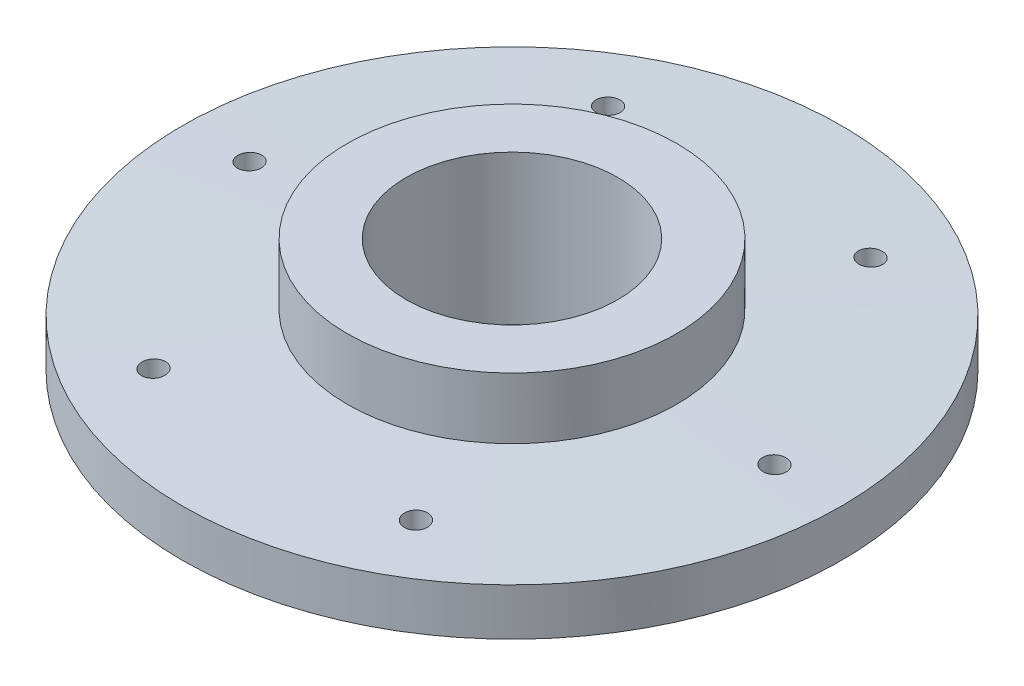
ISO-10303-21;
HEADER;
FILE_DESCRIPTION(('STEP AP214'),'2;1');
FILE_NAME('part.step','',(''),(''),'','','');
FILE_SCHEMA(('AUTOMOTIVE_DESIGN { 1 0 10303 214 1 1 1 1 }'));
ENDSEC;
DATA;
#1=APPLICATION_CONTEXT('core data for automotive mechanical design processes');
#2=APPLICATION_PROTOCOL_DEFINITION('international standard','automotive_design',2000,#1);
#3=PRODUCT_CONTEXT('',#1,'mechanical');
#4=PRODUCT('Part','Part','',(#3));
#5=PRODUCT_RELATED_PRODUCT_CATEGORY('part','',(#4));
#6=PRODUCT_DEFINITION_FORMATION('','',#4);
#7=PRODUCT_DEFINITION_CONTEXT('part definition',#1,'design');
#8=PRODUCT_DEFINITION('design','',#6,#7);
#9=PRODUCT_DEFINITION_SHAPE('','',#8);
#10=(LENGTH_UNIT() NAMED_UNIT(*) SI_UNIT(.MILLI.,.METRE.));
#11=(NAMED_UNIT(*) PLANE_ANGLE_UNIT() SI_UNIT($,.RADIAN.));
#12=(NAMED_UNIT(*) SI_UNIT($,.STERADIAN.) SOLID_ANGLE_UNIT());
#13=UNCERTAINTY_MEASURE_WITH_UNIT(LENGTH_MEASURE(1.E-05),#10,'distance_accuracy_value','');
#14=(GEOMETRIC_REPRESENTATION_CONTEXT(3) GLOBAL_UNCERTAINTY_ASSIGNED_CONTEXT((#13)) GLOBAL_UNIT_ASSIGNED_CONTEXT((#10,
#11,#12)) REPRESENTATION_CONTEXT('',''));
#15=CARTESIAN_POINT('',(0.,0.,0.));
#16=DIRECTION('',(0.,0.,1.));
#17=DIRECTION('',(1.,0.,0.));
#18=AXIS2_PLACEMENT_3D('',#15,#16,#17);
#19=CARTESIAN_POINT('',(0.,3.17222269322,0.));
#20=DIRECTION('',(0.,1.,0.));
#21=DIRECTION('',(0.,0.,1.));
#22=AXIS2_PLACEMENT_3D('',#19,#20,#21);
#23=CYLINDRICAL_SURFACE('',#22,4.5);
#24=CARTESIAN_POINT('',(0.,6.34444538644,0.));
#25=DIRECTION('',(0.,1.,0.));
#26=DIRECTION('',(0.,0.,1.));
#27=AXIS2_PLACEMENT_3D('',#24,#25,#26);
#28=CIRCLE('',#27,4.5);
#29=CARTESIAN_POINT('',(0.,6.34444538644,4.5));
#30=VERTEX_POINT('',#29);
#31=EDGE_CURVE('E153',#30,#30,#28,.F.);
#32=ORIENTED_EDGE('',*,*,#31,.F.);
#33=EDGE_LOOP('',(#32));
#34=FACE_BOUND('',#33,.T.);
#35=CARTESIAN_POINT('',(0.,0.,0.));
#36=DIRECTION('',(0.,1.,0.));
#37=DIRECTION('',(0.,0.,1.));
#38=AXIS2_PLACEMENT_3D('',#35,#36,#37);
#39=CIRCLE('',#38,4.5);
#40=CARTESIAN_POINT('',(0.,0.,4.5));
#41=VERTEX_POINT('',#40);
#42=EDGE_CURVE('E17',#41,#41,#39,.F.);
#43=ORIENTED_EDGE('',*,*,#42,.T.);
#44=EDGE_LOOP('',(#43));
#45=FACE_BOUND('',#44,.T.);
#46=ADVANCED_FACE('F14',(#34,#45),#23,.F.);
#47=CARTESIAN_POINT('',(0.,0.,8.));
#48=DIRECTION('',(0.,1.,0.));
#49=DIRECTION('',(0.,0.,1.));
#50=AXIS2_PLACEMENT_3D('',#47,#48,#49);
#51=PLANE('',#50);
#52=ORIENTED_EDGE('',*,*,#42,.F.);
#53=EDGE_LOOP('',(#52));
#54=FACE_BOUND('',#53,.T.);
#55=CARTESIAN_POINT('',(0.,-1.02522157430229E-12,0.));
#56=DIRECTION('',(0.,1.,0.));
#57=DIRECTION('',(-1.,0.,0.));
#58=AXIS2_PLACEMENT_3D('',#55,#56,#57);
#59=CIRCLE('',#58,7.9999999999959);
#60=CARTESIAN_POINT('',(-7.9999999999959,-1.02516720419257E-12,0.));
#61=VERTEX_POINT('',#60);
#62=EDGE_CURVE('E155',#61,#61,#59,.T.);
#63=ORIENTED_EDGE('',*,*,#62,.F.);
#64=EDGE_LOOP('',(#63));
#65=FACE_BOUND('',#64,.T.);
#66=ADVANCED_FACE('F165',(#54,#65),#51,.F.);
#67=CARTESIAN_POINT('',(0.,6.34444538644,4.5));
#68=DIRECTION('',(0.,1.,0.));
#69=DIRECTION('',(0.,0.,1.));
#70=AXIS2_PLACEMENT_3D('',#67,#68,#69);
#71=PLANE('',#70);
#72=ORIENTED_EDGE('',*,*,#31,.T.);
#73=EDGE_LOOP('',(#72));
#74=FACE_BOUND('',#73,.T.);
#75=CARTESIAN_POINT('',(0.,6.34444538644,0.));
#76=DIRECTION('',(0.,1.,0.));
#77=DIRECTION('',(0.,0.,1.));
#78=AXIS2_PLACEMENT_3D('',#75,#76,#77);
#79=CIRCLE('',#78,7.);
#80=CARTESIAN_POINT('',(0.,6.34444538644,7.));
#81=VERTEX_POINT('',#80);
#82=EDGE_CURVE('E73',#81,#81,#79,.F.);
#83=ORIENTED_EDGE('',*,*,#82,.F.);
#84=EDGE_LOOP('',(#83));
#85=FACE_BOUND('',#84,.T.);
#86=ADVANCED_FACE('F80',(#74,#85),#71,.T.);
#87=CARTESIAN_POINT('',(-5.575,3.,-9.6561832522));
#88=DIRECTION('',(0.,1.,0.));
#89=DIRECTION('',(0.,0.,1.));
#90=AXIS2_PLACEMENT_3D('',#87,#88,#89);
#91=CYLINDRICAL_SURFACE('',#90,0.5);
#92=CARTESIAN_POINT('',(-5.82499999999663,3.5820638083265,-10.0891959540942));
#93=CARTESIAN_POINT('',(-5.80068965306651,3.58206387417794,-10.1032291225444));
#94=CARTESIAN_POINT('',(-5.7751745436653,3.58214304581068,-10.1152242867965));
#95=CARTESIAN_POINT('',(-5.72246490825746,3.58245831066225,-10.1347705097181));
#96=CARTESIAN_POINT('',(-5.69526830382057,3.58269460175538,-10.1423159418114));
#97=CARTESIAN_POINT('',(-5.64794136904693,3.58322839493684,-10.1512409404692));
#98=CARTESIAN_POINT('',(-5.62802012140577,3.58348893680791,-10.1537679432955));
#99=CARTESIAN_POINT('',(-5.58802922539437,3.58408312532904,-10.1564149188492));
#100=CARTESIAN_POINT('',(-5.5679596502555,3.58441673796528,-10.1565360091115));
#101=CARTESIAN_POINT('',(-5.51989356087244,3.58530132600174,-10.153929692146));
#102=CARTESIAN_POINT('',(-5.49195308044,3.58588577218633,-10.150037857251));
#103=CARTESIAN_POINT('',(-5.43710420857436,3.58717608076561,-10.1376154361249));
#104=CARTESIAN_POINT('',(-5.41019691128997,3.58788206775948,-10.1290800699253));
#105=CARTESIAN_POINT('',(-5.35820994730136,3.58939654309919,-10.1076168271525));
#106=CARTESIAN_POINT('',(-5.33312949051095,3.59020498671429,-10.0946908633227));
#107=CARTESIAN_POINT('',(-5.28550201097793,3.59190311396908,-10.064816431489));
#108=CARTESIAN_POINT('',(-5.26295447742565,3.59279278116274,-10.047868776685));
#109=CARTESIAN_POINT('',(-5.2210145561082,3.5946301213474,-10.0104218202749));
#110=CARTESIAN_POINT('',(-5.20162371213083,3.59557782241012,-9.98992079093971));
#111=CARTESIAN_POINT('',(-5.16655964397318,3.5975049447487,-9.94595412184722));
#112=CARTESIAN_POINT('',(-5.15088654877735,3.59848436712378,-9.92248837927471));
#113=CARTESIAN_POINT('',(-5.12369785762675,3.60044790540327,-9.87324914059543));
#114=CARTESIAN_POINT('',(-5.11218384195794,3.60143202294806,-9.84747477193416));
#115=CARTESIAN_POINT('',(-5.093648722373,3.60337641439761,-9.79435774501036));
#116=CARTESIAN_POINT('',(-5.08662756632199,3.60433668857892,-9.76701510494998));
#117=CARTESIAN_POINT('',(-5.07727779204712,3.60620532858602,-9.71153610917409));
#118=CARTESIAN_POINT('',(-5.07494932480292,3.60711369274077,-9.68339972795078));
#119=CARTESIAN_POINT('',(-5.0750523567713,3.60885127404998,-9.62713288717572));
#120=CARTESIAN_POINT('',(-5.07748401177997,3.609680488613,-9.59900242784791));
#121=CARTESIAN_POINT('',(-5.08715781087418,3.61125345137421,-9.54286559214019));
#122=CARTESIAN_POINT('',(-5.09451632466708,3.61199460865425,-9.51487913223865));
#123=CARTESIAN_POINT('',(-5.11394601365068,3.61334301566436,-9.46057962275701));
#124=CARTESIAN_POINT('',(-5.12601850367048,3.61395022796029,-9.43426704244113));
#125=CARTESIAN_POINT('',(-5.15415289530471,3.61499685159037,-9.38474492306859));
#126=CARTESIAN_POINT('',(-5.17010701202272,3.6154400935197,-9.36147405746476));
#127=CARTESIAN_POINT('',(-5.20568261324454,3.616165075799,-9.31796409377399));
#128=CARTESIAN_POINT('',(-5.22529876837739,3.61644704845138,-9.29772066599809));
#129=CARTESIAN_POINT('',(-5.25860346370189,3.61675723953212,-9.26868645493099));
#130=CARTESIAN_POINT('',(-5.2712602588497,3.6168423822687,-9.25868895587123));
#131=CARTESIAN_POINT('',(-5.29747894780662,3.61695606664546,-9.23996022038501));
#132=CARTESIAN_POINT('',(-5.31104085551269,3.61698460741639,-9.23122900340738));
#133=CARTESIAN_POINT('',(-5.34930797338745,3.61698452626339,-9.2091378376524));
#134=CARTESIAN_POINT('',(-5.37482050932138,3.61689783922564,-9.19714518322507));
#135=CARTESIAN_POINT('',(-5.42751932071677,3.61655356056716,-9.17760071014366));
#136=CARTESIAN_POINT('',(-5.4547078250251,3.61629573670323,-9.17005495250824));
#137=CARTESIAN_POINT('',(-5.50995143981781,3.61561759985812,-9.15963723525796));
#138=CARTESIAN_POINT('',(-5.53800606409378,3.61519737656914,-9.15676270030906));
#139=CARTESIAN_POINT('',(-5.59418843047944,3.61420810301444,-9.15576233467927));
#140=CARTESIAN_POINT('',(-5.62231614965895,3.61363909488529,-9.15763516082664));
#141=CARTESIAN_POINT('',(-5.67786802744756,3.6123700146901,-9.16607330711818));
#142=CARTESIAN_POINT('',(-5.70529188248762,3.61166988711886,-9.17264061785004));
#143=CARTESIAN_POINT('',(-5.75864737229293,3.6101605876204,-9.19028281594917));
#144=CARTESIAN_POINT('',(-5.78457893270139,3.60935141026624,-9.20135792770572));
#145=CARTESIAN_POINT('',(-5.83422913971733,3.60764833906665,-9.22770851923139));
#146=CARTESIAN_POINT('',(-5.85794644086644,3.60675439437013,-9.24298653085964));
#147=CARTESIAN_POINT('',(-5.9024783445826,3.60490906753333,-9.27730574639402));
#148=CARTESIAN_POINT('',(-5.92329295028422,3.60395768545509,-9.2963469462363));
#149=CARTESIAN_POINT('',(-5.96144046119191,3.6020248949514,-9.33766359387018));
#150=CARTESIAN_POINT('',(-5.97877145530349,3.60104347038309,-9.35994080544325));
#151=CARTESIAN_POINT('',(-6.00944591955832,3.59907929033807,-9.40708944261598));
#152=CARTESIAN_POINT('',(-6.02278938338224,3.59809653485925,-9.4319608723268));
#153=CARTESIAN_POINT('',(-6.04511244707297,3.59615707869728,-9.48359808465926));
#154=CARTESIAN_POINT('',(-6.05409108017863,3.59520038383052,-9.51036428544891));
#155=CARTESIAN_POINT('',(-6.06742453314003,3.59333957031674,-9.56502666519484));
#156=CARTESIAN_POINT('',(-6.07177930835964,3.59243545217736,-9.59292285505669));
#157=CARTESIAN_POINT('',(-6.0757399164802,3.5907042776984,-9.64904907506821));
#158=CARTESIAN_POINT('',(-6.07534637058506,3.58987721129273,-9.67727906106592));
#159=CARTESIAN_POINT('',(-6.06982185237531,3.58832195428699,-9.73327200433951));
#160=CARTESIAN_POINT('',(-6.06469129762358,3.58759375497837,-9.7610350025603));
#161=CARTESIAN_POINT('',(-6.04984303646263,3.58625555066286,-9.81528892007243));
#162=CARTESIAN_POINT('',(-6.0401283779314,3.58564546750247,-9.84178067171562));
#163=CARTESIAN_POINT('',(-6.01638089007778,3.58455828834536,-9.89277174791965));
#164=CARTESIAN_POINT('',(-6.00234600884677,3.58408125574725,-9.91727011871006));
#165=CARTESIAN_POINT('',(-5.97035715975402,3.58327256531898,-9.96356757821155));
#166=CARTESIAN_POINT('',(-5.95240205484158,3.58294094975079,-9.98536588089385));
#167=CARTESIAN_POINT('',(-5.91311331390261,3.58243224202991,-10.0255976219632));
#168=CARTESIAN_POINT('',(-5.89178712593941,3.58225481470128,-10.0440382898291));
#169=CARTESIAN_POINT('',(-5.85490627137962,3.58209460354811,-10.0708655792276));
#170=CARTESIAN_POINT('',(-5.84018826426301,3.58206376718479,-10.0804285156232));
#171=CARTESIAN_POINT('',(-5.82499999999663,3.5820638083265,-10.0891959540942));
#172=B_SPLINE_CURVE_WITH_KNOTS('',3,(#92,#93,#94,#95,#96,#97,#98,#99,#100,#101,#102,#103,#104,
#105,#106,#107,#108,#109,#110,#111,#112,#113,#114,#115,#116,#117,#118,#119,#120,#121,#122,#123,
#124,#125,#126,#127,#128,#129,#130,#131,#132,#133,#134,#135,#136,#137,#138,#139,#140,#141,#142,
#143,#144,#145,#146,#147,#148,#149,#150,#151,#152,#153,#154,#155,#156,#157,#158,#159,#160,#161,
#162,#163,#164,#165,#166,#167,#168,#169,#170,#171),.UNSPECIFIED.,.T.,.F.,(4,2,2,2,2,2,2,2,2,2,2,
2,2,2,2,2,2,2,2,2,2,2,2,2,2,2,2,2,2,2,2,2,2,2,2,2,2,2,2,4),(0.,0.0841561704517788,
0.168418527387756,0.228527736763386,0.288609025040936,0.37283815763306,0.45715415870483,
0.541433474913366,0.625695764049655,0.709999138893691,0.79430543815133,0.878643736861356,
0.962981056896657,1.04732109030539,1.13166388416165,1.21807257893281,1.3045053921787,
1.38876789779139,1.4729087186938,1.52122859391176,1.56954921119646,1.65369306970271,
1.73795135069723,1.82216316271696,1.90635115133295,1.99057485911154,2.07480275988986,
2.15908151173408,2.24336017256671,2.32768494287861,2.41200984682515,2.49635341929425,
2.58069780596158,2.66503115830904,2.74935707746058,2.83362700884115,2.91793702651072,
3.00227153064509,3.08642224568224,3.13900011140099),.UNSPECIFIED.);
#173=CARTESIAN_POINT('',(-5.82499999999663,3.5820638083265,-10.0891959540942));
#174=VERTEX_POINT('',#173);
#175=EDGE_CURVE('E67',#174,#174,#172,.T.);
#176=ORIENTED_EDGE('',*,*,#175,.F.);
#177=EDGE_LOOP('',(#176));
#178=FACE_BOUND('',#177,.T.);
#179=CARTESIAN_POINT('',(-5.5479481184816,0.893018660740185,-10.1554509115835));
#180=CARTESIAN_POINT('',(-5.57526211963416,0.896617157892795,-10.1569310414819));
#181=CARTESIAN_POINT('',(-5.60275850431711,0.899762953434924,-10.156167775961));
#182=CARTESIAN_POINT('',(-5.6573352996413,0.905057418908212,-10.1501199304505));
#183=CARTESIAN_POINT('',(-5.68441601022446,0.90720684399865,-10.1448387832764));
#184=CARTESIAN_POINT('',(-5.73079390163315,0.9100450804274,-10.131742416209));
#185=CARTESIAN_POINT('',(-5.75035268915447,0.91096414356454,-10.1248833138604));
#186=CARTESIAN_POINT('',(-5.78848720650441,0.912191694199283,-10.108788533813));
#187=CARTESIAN_POINT('',(-5.80706293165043,0.912500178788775,-10.099552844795));
#188=CARTESIAN_POINT('',(-5.84883091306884,0.912499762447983,-10.0754359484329));
#189=CARTESIAN_POINT('',(-5.87153450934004,0.911954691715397,-10.0596968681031));
#190=CARTESIAN_POINT('',(-5.91402562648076,0.909789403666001,-10.0247210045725));
#191=CARTESIAN_POINT('',(-5.93381082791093,0.90816833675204,-10.0054814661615));
#192=CARTESIAN_POINT('',(-5.96989298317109,0.903900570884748,-9.96409928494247));
#193=CARTESIAN_POINT('',(-5.98619296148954,0.901254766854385,-9.94195918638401));
#194=CARTESIAN_POINT('',(-6.01490426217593,0.895014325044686,-9.89541542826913));
#195=CARTESIAN_POINT('',(-6.02731601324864,0.89141979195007,-9.8710120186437));
#196=CARTESIAN_POINT('',(-6.0480873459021,0.883334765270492,-9.82033828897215));
#197=CARTESIAN_POINT('',(-6.05639793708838,0.878834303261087,-9.79404950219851));
#198=CARTESIAN_POINT('',(-6.06858472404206,0.869087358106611,-9.74059792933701));
#199=CARTESIAN_POINT('',(-6.07246032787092,0.863840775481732,-9.71343502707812));
#200=CARTESIAN_POINT('',(-6.07577880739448,0.852594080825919,-9.6582537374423));
#201=CARTESIAN_POINT('',(-6.07510336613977,0.8465778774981,-9.63023152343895));
#202=CARTESIAN_POINT('',(-6.06911913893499,0.834064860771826,-9.57479621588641));
#203=CARTESIAN_POINT('',(-6.0638096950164,0.827567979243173,-9.54738320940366));
#204=CARTESIAN_POINT('',(-6.04854300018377,0.814085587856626,-9.49317854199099));
#205=CARTESIAN_POINT('',(-6.03846643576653,0.807091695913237,-9.46642253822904));
#206=CARTESIAN_POINT('',(-6.01393149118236,0.792963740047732,-9.41504028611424));
#207=CARTESIAN_POINT('',(-5.99947262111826,0.785829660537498,-9.39041427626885));
#208=CARTESIAN_POINT('',(-5.96630754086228,0.771501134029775,-9.34358994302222));
#209=CARTESIAN_POINT('',(-5.94753674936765,0.764307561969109,-9.32143704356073));
#210=CARTESIAN_POINT('',(-5.90639835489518,0.750184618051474,-9.28066516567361));
#211=CARTESIAN_POINT('',(-5.88403062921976,0.743255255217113,-9.26204630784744));
#212=CARTESIAN_POINT('',(-5.83636264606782,0.729886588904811,-9.22894846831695));
#213=CARTESIAN_POINT('',(-5.81106904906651,0.723446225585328,-9.2144603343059));
#214=CARTESIAN_POINT('',(-5.7582152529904,0.711247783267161,-9.19005118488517));
#215=CARTESIAN_POINT('',(-5.73065547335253,0.705489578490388,-9.18012932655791));
#216=CARTESIAN_POINT('',(-5.67467883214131,0.694970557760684,-9.16538414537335));
#217=CARTESIAN_POINT('',(-5.64629334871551,0.69019088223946,-9.16045530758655));
#218=CARTESIAN_POINT('',(-5.58893078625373,0.681647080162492,-9.15554939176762));
#219=CARTESIAN_POINT('',(-5.55995352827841,0.677883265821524,-9.15557383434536));
#220=CARTESIAN_POINT('',(-5.50320152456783,0.671617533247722,-9.16057045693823));
#221=CARTESIAN_POINT('',(-5.47541716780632,0.669080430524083,-9.16539075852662));
#222=CARTESIAN_POINT('',(-5.42102775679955,0.665202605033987,-9.17965478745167));
#223=CARTESIAN_POINT('',(-5.39441998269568,0.663858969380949,-9.18908717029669));
#224=CARTESIAN_POINT('',(-5.3538449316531,0.662711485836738,-9.2074499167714));
#225=CARTESIAN_POINT('',(-5.33922375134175,0.662499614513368,-9.21495686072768));
#226=CARTESIAN_POINT('',(-5.3012543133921,0.662500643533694,-9.23688280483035));
#227=CARTESIAN_POINT('',(-5.27861627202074,0.663092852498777,-9.25256477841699));
#228=CARTESIAN_POINT('',(-5.23623663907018,0.665443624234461,-9.2874105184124));
#229=CARTESIAN_POINT('',(-5.2164981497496,0.667203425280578,-9.30657796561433));
#230=CARTESIAN_POINT('',(-5.18741444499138,0.67093106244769,-9.33985803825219));
#231=CARTESIAN_POINT('',(-5.17699043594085,0.67255897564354,-9.35308198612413));
#232=CARTESIAN_POINT('',(-5.15755236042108,0.676206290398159,-9.3804671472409));
#233=CARTESIAN_POINT('',(-5.14853760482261,0.678225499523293,-9.39462789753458));
#234=CARTESIAN_POINT('',(-5.12626695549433,0.684157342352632,-9.43383149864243));
#235=CARTESIAN_POINT('',(-5.11439264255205,0.68841334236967,-9.45962410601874));
#236=CARTESIAN_POINT('',(-5.09518916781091,0.697827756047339,-9.51272234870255));
#237=CARTESIAN_POINT('',(-5.08786708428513,0.702987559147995,-9.54003026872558));
#238=CARTESIAN_POINT('',(-5.07792948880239,0.714023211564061,-9.5952949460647));
#239=CARTESIAN_POINT('',(-5.07530552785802,0.719897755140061,-9.62325044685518));
#240=CARTESIAN_POINT('',(-5.07474485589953,0.732185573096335,-9.67907788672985));
#241=CARTESIAN_POINT('',(-5.07680700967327,0.738598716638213,-9.7069498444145));
#242=CARTESIAN_POINT('',(-5.08560871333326,0.751929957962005,-9.76250800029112));
#243=CARTESIAN_POINT('',(-5.09245352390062,0.758856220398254,-9.79017557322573));
#244=CARTESIAN_POINT('',(-5.11071300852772,0.772882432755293,-9.84391501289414));
#245=CARTESIAN_POINT('',(-5.12212841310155,0.779982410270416,-9.86998662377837));
#246=CARTESIAN_POINT('',(-5.1494650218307,0.794293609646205,-9.92029429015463));
#247=CARTESIAN_POINT('',(-5.16546652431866,0.801504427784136,-9.94448688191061));
#248=CARTESIAN_POINT('',(-5.20144476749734,0.81570256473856,-9.98978964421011));
#249=CARTESIAN_POINT('',(-5.22142181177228,0.822689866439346,-10.0108995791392));
#250=CARTESIAN_POINT('',(-5.26480203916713,0.836243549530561,-10.0493982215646));
#251=CARTESIAN_POINT('',(-5.28820429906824,0.84281004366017,-10.0667879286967));
#252=CARTESIAN_POINT('',(-5.33778835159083,0.85533577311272,-10.0972923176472));
#253=CARTESIAN_POINT('',(-5.3639692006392,0.861295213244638,-10.1104084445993));
#254=CARTESIAN_POINT('',(-5.41602970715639,0.871955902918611,-10.1309926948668));
#255=CARTESIAN_POINT('',(-5.44174392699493,0.876721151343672,-10.1388476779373));
#256=CARTESIAN_POINT('',(-5.49422898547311,0.88547735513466,-10.1503465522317));
#257=CARTESIAN_POINT('',(-5.52099978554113,0.889468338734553,-10.1539905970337));
#258=CARTESIAN_POINT('',(-5.5479481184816,0.893018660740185,-10.1554509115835));
#259=B_SPLINE_CURVE_WITH_KNOTS('',3,(#179,#180,#181,#182,#183,#184,#185,#186,#187,#188,#189,
#190,#191,#192,#193,#194,#195,#196,#197,#198,#199,#200,#201,#202,#203,#204,#205,#206,#207,#208,
#209,#210,#211,#212,#213,#214,#215,#216,#217,#218,#219,#220,#221,#222,#223,#224,#225,#226,#227,
#228,#229,#230,#231,#232,#233,#234,#235,#236,#237,#238,#239,#240,#241,#242,#243,#244,#245,#246,
#247,#248,#249,#250,#251,#252,#253,#254,#255,#256,#257,#258),.UNSPECIFIED.,.T.,.F.,(4,2,2,2,2,2,
2,2,2,2,2,2,2,2,2,2,2,2,2,2,2,2,2,2,2,2,2,2,2,2,2,2,2,2,2,2,2,2,2,4),(0.,0.082676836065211,
0.165290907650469,0.227370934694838,0.289451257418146,0.371930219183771,0.454474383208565,
0.536946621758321,0.619409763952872,0.702835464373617,0.786272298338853,0.871886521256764,
0.957512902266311,1.04540593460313,1.13330879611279,1.22262566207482,1.31194557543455,
1.40106601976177,1.49017000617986,1.57734904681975,1.66455485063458,1.74908414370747,
1.83340655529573,1.88265165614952,1.96486335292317,2.04716237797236,2.09782986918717,
2.14847250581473,2.23415742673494,2.31997524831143,2.40563858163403,2.49128116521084,
2.5788705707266,2.66647398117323,2.75571625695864,2.84496535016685,2.934190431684,
3.02338530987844,3.10495827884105,3.18652827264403),.UNSPECIFIED.);
#260=CARTESIAN_POINT('',(-5.5479481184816,0.893018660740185,-10.1554509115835));
#261=VERTEX_POINT('',#260);
#262=EDGE_CURVE('E85',#261,#261,#259,.T.);
#263=ORIENTED_EDGE('',*,*,#262,.F.);
#264=EDGE_LOOP('',(#263));
#265=FACE_BOUND('',#264,.T.);
#266=ADVANCED_FACE('F75',(#178,#265),#91,.F.);
#267=CARTESIAN_POINT('',(5.575,3.,9.6561832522));
#268=DIRECTION('',(0.,1.,0.));
#269=DIRECTION('',(0.,0.,1.));
#270=AXIS2_PLACEMENT_3D('',#267,#268,#269);
#271=CYLINDRICAL_SURFACE('',#270,0.5);
#272=CARTESIAN_POINT('',(5.82499999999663,3.5820638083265,10.0891959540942));
#273=CARTESIAN_POINT('',(5.80068965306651,3.58206387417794,10.1032291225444));
#274=CARTESIAN_POINT('',(5.77517454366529,3.58214304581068,10.1152242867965));
#275=CARTESIAN_POINT('',(5.72246490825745,3.58245831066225,10.1347705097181));
#276=CARTESIAN_POINT('',(5.69526830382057,3.58269460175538,10.1423159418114));
#277=CARTESIAN_POINT('',(5.64794136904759,3.58322839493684,10.151240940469));
#278=CARTESIAN_POINT('',(5.62802012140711,3.58348893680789,10.1537679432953));
#279=CARTESIAN_POINT('',(5.58802922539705,3.584083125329,10.1564149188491));
#280=CARTESIAN_POINT('',(5.56795965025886,3.58441673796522,10.1565360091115));
#281=CARTESIAN_POINT('',(5.51989356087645,3.58530132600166,10.1539296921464));
#282=CARTESIAN_POINT('',(5.49195308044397,3.58588577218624,10.1500378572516));
#283=CARTESIAN_POINT('',(5.43710420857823,3.58717608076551,10.137615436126));
#284=CARTESIAN_POINT('',(5.41019691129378,3.58788206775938,10.1290800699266));
#285=CARTESIAN_POINT('',(5.35820994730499,3.58939654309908,10.1076168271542));
#286=CARTESIAN_POINT('',(5.33312949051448,3.59020498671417,10.0946908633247));
#287=CARTESIAN_POINT('',(5.28550201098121,3.59190311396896,10.0648164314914));
#288=CARTESIAN_POINT('',(5.2629544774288,3.59279278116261,10.0478687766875));
#289=CARTESIAN_POINT('',(5.22101455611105,3.59463012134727,10.0104218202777));
#290=CARTESIAN_POINT('',(5.20162371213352,3.59557782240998,9.98992079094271));
#291=CARTESIAN_POINT('',(5.16655964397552,3.59750494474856,9.9459541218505));
#292=CARTESIAN_POINT('',(5.1508865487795,3.59848436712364,9.92248837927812));
#293=CARTESIAN_POINT('',(5.1236978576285,3.60044790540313,9.87324914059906));
#294=CARTESIAN_POINT('',(5.11218384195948,3.60143202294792,9.84747477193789));
#295=CARTESIAN_POINT('',(5.09364872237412,3.60337641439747,9.79435774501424));
#296=CARTESIAN_POINT('',(5.08662756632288,3.60433668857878,9.76701510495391));
#297=CARTESIAN_POINT('',(5.07727779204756,3.60620532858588,9.7115361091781));
#298=CARTESIAN_POINT('',(5.07494932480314,3.60711369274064,9.68339972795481));
#299=CARTESIAN_POINT('',(5.07505235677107,3.60885127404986,9.62713288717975));
#300=CARTESIAN_POINT('',(5.07748401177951,3.60968048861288,9.59900242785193));
#301=CARTESIAN_POINT('',(5.08715781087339,3.61125345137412,9.54286559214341));
#302=CARTESIAN_POINT('',(5.09451632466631,3.61199460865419,9.51487913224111));
#303=CARTESIAN_POINT('',(5.1139460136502,3.61334301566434,9.46057962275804));
#304=CARTESIAN_POINT('',(5.12601850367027,3.61395022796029,9.43426704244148));
#305=CARTESIAN_POINT('',(5.15415289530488,3.61499685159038,9.38474492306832));
#306=CARTESIAN_POINT('',(5.1701070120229,3.61544009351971,9.36147405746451));
#307=CARTESIAN_POINT('',(5.20568261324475,3.616165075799,9.31796409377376));
#308=CARTESIAN_POINT('',(5.22529876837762,3.61644704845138,9.29772066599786));
#309=CARTESIAN_POINT('',(5.2586034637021,3.61675723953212,9.26868645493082));
#310=CARTESIAN_POINT('',(5.27126025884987,3.6168423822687,9.2586889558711));
#311=CARTESIAN_POINT('',(5.29747894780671,3.61695606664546,9.23996022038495));
#312=CARTESIAN_POINT('',(5.31104085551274,3.61698460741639,9.23122900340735));
#313=CARTESIAN_POINT('',(5.34930797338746,3.61698452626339,9.2091378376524));
#314=CARTESIAN_POINT('',(5.37482050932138,3.61689783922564,9.19714518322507));
#315=CARTESIAN_POINT('',(5.42751932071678,3.61655356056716,9.17760071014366));
#316=CARTESIAN_POINT('',(5.4547078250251,3.61629573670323,9.17005495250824));
#317=CARTESIAN_POINT('',(5.50995143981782,3.61561759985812,9.15963723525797));
#318=CARTESIAN_POINT('',(5.53800606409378,3.61519737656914,9.15676270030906));
#319=CARTESIAN_POINT('',(5.59418843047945,3.61420810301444,9.15576233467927));
#320=CARTESIAN_POINT('',(5.62231614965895,3.61363909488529,9.15763516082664));
#321=CARTESIAN_POINT('',(5.67786802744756,3.6123700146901,9.16607330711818));
#322=CARTESIAN_POINT('',(5.70529188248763,3.61166988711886,9.17264061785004));
#323=CARTESIAN_POINT('',(5.75864737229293,3.6101605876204,9.19028281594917));
#324=CARTESIAN_POINT('',(5.78457893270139,3.60935141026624,9.20135792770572));
#325=CARTESIAN_POINT('',(5.83422913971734,3.60764833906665,9.22770851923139));
#326=CARTESIAN_POINT('',(5.85794644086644,3.60675439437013,9.24298653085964));
#327=CARTESIAN_POINT('',(5.90247834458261,3.60490906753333,9.27730574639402));
#328=CARTESIAN_POINT('',(5.92329295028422,3.60395768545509,9.2963469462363));
#329=CARTESIAN_POINT('',(5.96144046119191,3.6020248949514,9.33766359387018));
#330=CARTESIAN_POINT('',(5.9787714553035,3.60104347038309,9.35994080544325));
#331=CARTESIAN_POINT('',(6.00944591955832,3.59907929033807,9.40708944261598));
#332=CARTESIAN_POINT('',(6.02278938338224,3.59809653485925,9.4319608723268));
#333=CARTESIAN_POINT('',(6.04511244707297,3.59615707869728,9.48359808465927));
#334=CARTESIAN_POINT('',(6.05409108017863,3.59520038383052,9.51036428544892));
#335=CARTESIAN_POINT('',(6.06742453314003,3.59333957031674,9.56502666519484));
#336=CARTESIAN_POINT('',(6.07177930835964,3.59243545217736,9.59292285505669));
#337=CARTESIAN_POINT('',(6.0757399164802,3.5907042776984,9.64904907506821));
#338=CARTESIAN_POINT('',(6.07534637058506,3.58987721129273,9.67727906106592));
#339=CARTESIAN_POINT('',(6.06982185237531,3.58832195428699,9.73327200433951));
#340=CARTESIAN_POINT('',(6.06469129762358,3.58759375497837,9.7610350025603));
#341=CARTESIAN_POINT('',(6.04984303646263,3.58625555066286,9.81528892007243));
#342=CARTESIAN_POINT('',(6.0401283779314,3.58564546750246,9.84178067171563));
#343=CARTESIAN_POINT('',(6.01638089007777,3.58455828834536,9.89277174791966));
#344=CARTESIAN_POINT('',(6.00234600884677,3.58408125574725,9.91727011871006));
#345=CARTESIAN_POINT('',(5.97035715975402,3.58327256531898,9.96356757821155));
#346=CARTESIAN_POINT('',(5.95240205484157,3.58294094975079,9.98536588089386));
#347=CARTESIAN_POINT('',(5.91311331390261,3.58243224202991,10.0255976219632));
#348=CARTESIAN_POINT('',(5.89178712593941,3.58225481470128,10.0440382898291));
#349=CARTESIAN_POINT('',(5.85490627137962,3.58209460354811,10.0708655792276));
#350=CARTESIAN_POINT('',(5.84018826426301,3.58206376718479,10.0804285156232));
#351=CARTESIAN_POINT('',(5.82499999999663,3.5820638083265,10.0891959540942));
#352=B_SPLINE_CURVE_WITH_KNOTS('',3,(#272,#273,#274,#275,#276,#277,#278,#279,#280,#281,#282,
#283,#284,#285,#286,#287,#288,#289,#290,#291,#292,#293,#294,#295,#296,#297,#298,#299,#300,#301,
#302,#303,#304,#305,#306,#307,#308,#309,#310,#311,#312,#313,#314,#315,#316,#317,#318,#319,#320,
#321,#322,#323,#324,#325,#326,#327,#328,#329,#330,#331,#332,#333,#334,#335,#336,#337,#338,#339,
#340,#341,#342,#343,#344,#345,#346,#347,#348,#349,#350,#351),.UNSPECIFIED.,.T.,.F.,(4,2,2,2,2,2,
2,2,2,2,2,2,2,2,2,2,2,2,2,2,2,2,2,2,2,2,2,2,2,2,2,2,2,2,2,2,2,2,2,4),(0.,0.0841561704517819,
0.168418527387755,0.228527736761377,0.288609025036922,0.372838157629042,0.457154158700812,
0.541433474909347,0.625695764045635,0.709999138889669,0.794305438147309,0.878643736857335,
0.962981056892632,1.04732109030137,1.13166388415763,1.21807257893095,1.30450539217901,
1.3887678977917,1.47290871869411,1.52122859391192,1.56954921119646,1.65369306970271,
1.73795135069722,1.82216316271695,1.90635115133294,1.99057485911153,2.07480275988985,
2.15908151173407,2.2433601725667,2.32768494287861,2.41200984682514,2.49635341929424,
2.58069780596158,2.66503115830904,2.74935707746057,2.83362700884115,2.91793702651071,
3.00227153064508,3.08642224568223,3.13900011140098),.UNSPECIFIED.);
#353=CARTESIAN_POINT('',(5.82499999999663,3.5820638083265,10.0891959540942));
#354=VERTEX_POINT('',#353);
#355=EDGE_CURVE('E62',#354,#354,#352,.T.);
#356=ORIENTED_EDGE('',*,*,#355,.F.);
#357=EDGE_LOOP('',(#356));
#358=FACE_BOUND('',#357,.T.);
#359=CARTESIAN_POINT('',(5.32500000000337,0.662499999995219,9.22317055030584));
#360=CARTESIAN_POINT('',(5.30125431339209,0.662500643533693,9.23688280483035));
#361=CARTESIAN_POINT('',(5.27861627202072,0.663092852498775,9.25256477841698));
#362=CARTESIAN_POINT('',(5.23623663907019,0.665443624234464,9.2874105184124));
#363=CARTESIAN_POINT('',(5.21649814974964,0.667203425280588,9.30657796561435));
#364=CARTESIAN_POINT('',(5.18741444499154,0.670931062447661,9.33985803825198));
#365=CARTESIAN_POINT('',(5.1769904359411,0.67255897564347,9.35308198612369));
#366=CARTESIAN_POINT('',(5.1575523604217,0.676206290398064,9.38046714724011));
#367=CARTESIAN_POINT('',(5.1485376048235,0.678225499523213,9.39462789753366));
#368=CARTESIAN_POINT('',(5.12626695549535,0.684157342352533,9.43383149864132));
#369=CARTESIAN_POINT('',(5.11439264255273,0.688413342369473,9.45962410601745));
#370=CARTESIAN_POINT('',(5.09518916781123,0.697827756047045,9.51272234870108));
#371=CARTESIAN_POINT('',(5.08786708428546,0.702987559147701,9.54003026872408));
#372=CARTESIAN_POINT('',(5.07792948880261,0.714023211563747,9.59529494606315));
#373=CARTESIAN_POINT('',(5.07530552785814,0.719897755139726,9.62325044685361));
#374=CARTESIAN_POINT('',(5.07474485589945,0.732185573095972,9.67907788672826));
#375=CARTESIAN_POINT('',(5.07680700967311,0.738598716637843,9.70694984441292));
#376=CARTESIAN_POINT('',(5.08560871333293,0.751929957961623,9.76250800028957));
#377=CARTESIAN_POINT('',(5.0924535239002,0.758856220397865,9.7901755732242));
#378=CARTESIAN_POINT('',(5.11071300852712,0.772882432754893,9.84391501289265));
#379=CARTESIAN_POINT('',(5.12212841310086,0.779982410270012,9.86998662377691));
#380=CARTESIAN_POINT('',(5.14946502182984,0.794293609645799,9.92029429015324));
#381=CARTESIAN_POINT('',(5.16546652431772,0.801504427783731,9.94448688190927));
#382=CARTESIAN_POINT('',(5.20144476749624,0.815702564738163,9.98978964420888));
#383=CARTESIAN_POINT('',(5.22142181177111,0.822689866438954,10.010899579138));
#384=CARTESIAN_POINT('',(5.26480203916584,0.836243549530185,10.0493982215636));
#385=CARTESIAN_POINT('',(5.28820429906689,0.842810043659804,10.0667879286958));
#386=CARTESIAN_POINT('',(5.33778835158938,0.855335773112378,10.0972923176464));
#387=CARTESIAN_POINT('',(5.3639692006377,0.86129521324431,10.1104084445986));
#388=CARTESIAN_POINT('',(5.41602970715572,0.871955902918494,10.1309926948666));
#389=CARTESIAN_POINT('',(5.44174392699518,0.876721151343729,10.1388476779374));
#390=CARTESIAN_POINT('',(5.49422898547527,0.885477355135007,10.1503465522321));
#391=CARTESIAN_POINT('',(5.52099978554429,0.889468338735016,10.1539905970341));
#392=CARTESIAN_POINT('',(5.57526211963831,0.896617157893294,10.1569310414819));
#393=CARTESIAN_POINT('',(5.60275850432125,0.899762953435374,10.1561677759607));
#394=CARTESIAN_POINT('',(5.65733529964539,0.905057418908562,10.1501199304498));
#395=CARTESIAN_POINT('',(5.6844160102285,0.907206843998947,10.1448387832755));
#396=CARTESIAN_POINT('',(5.73079390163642,0.910045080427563,10.1317424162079));
#397=CARTESIAN_POINT('',(5.75035268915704,0.910964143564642,10.1248833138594));
#398=CARTESIAN_POINT('',(5.78848720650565,0.912191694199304,10.1087885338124));
#399=CARTESIAN_POINT('',(5.80706293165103,0.912500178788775,10.0995528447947));
#400=CARTESIAN_POINT('',(5.84883091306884,0.912499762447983,10.0754359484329));
#401=CARTESIAN_POINT('',(5.87153450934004,0.911954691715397,10.0596968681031));
#402=CARTESIAN_POINT('',(5.91402562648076,0.909789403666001,10.0247210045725));
#403=CARTESIAN_POINT('',(5.93381082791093,0.90816833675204,10.0054814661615));
#404=CARTESIAN_POINT('',(5.9698929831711,0.903900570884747,9.96409928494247));
#405=CARTESIAN_POINT('',(5.98619296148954,0.901254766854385,9.94195918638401));
#406=CARTESIAN_POINT('',(6.01490426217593,0.895014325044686,9.89541542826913));
#407=CARTESIAN_POINT('',(6.02731601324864,0.89141979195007,9.8710120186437));
#408=CARTESIAN_POINT('',(6.0480873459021,0.883334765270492,9.82033828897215));
#409=CARTESIAN_POINT('',(6.05639793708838,0.878834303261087,9.79404950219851));
#410=CARTESIAN_POINT('',(6.06858472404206,0.869087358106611,9.74059792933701));
#411=CARTESIAN_POINT('',(6.07246032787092,0.863840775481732,9.71343502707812));
#412=CARTESIAN_POINT('',(6.07577880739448,0.852594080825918,9.6582537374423));
#413=CARTESIAN_POINT('',(6.07510336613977,0.8465778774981,9.63023152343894));
#414=CARTESIAN_POINT('',(6.06911913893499,0.834064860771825,9.57479621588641));
#415=CARTESIAN_POINT('',(6.0638096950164,0.827567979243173,9.54738320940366));
#416=CARTESIAN_POINT('',(6.04854300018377,0.814085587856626,9.49317854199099));
#417=CARTESIAN_POINT('',(6.03846643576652,0.807091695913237,9.46642253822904));
#418=CARTESIAN_POINT('',(6.01393149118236,0.792963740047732,9.41504028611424));
#419=CARTESIAN_POINT('',(5.99947262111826,0.785829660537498,9.39041427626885));
#420=CARTESIAN_POINT('',(5.96630754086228,0.771501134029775,9.34358994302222));
#421=CARTESIAN_POINT('',(5.94753674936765,0.764307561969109,9.32143704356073));
#422=CARTESIAN_POINT('',(5.90639835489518,0.750184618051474,9.28066516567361));
#423=CARTESIAN_POINT('',(5.88403062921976,0.743255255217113,9.26204630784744));
#424=CARTESIAN_POINT('',(5.83636264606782,0.729886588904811,9.22894846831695));
#425=CARTESIAN_POINT('',(5.81106904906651,0.723446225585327,9.2144603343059));
#426=CARTESIAN_POINT('',(5.7582152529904,0.711247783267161,9.19005118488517));
#427=CARTESIAN_POINT('',(5.73065547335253,0.705489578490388,9.18012932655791));
#428=CARTESIAN_POINT('',(5.67467883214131,0.694970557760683,9.16538414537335));
#429=CARTESIAN_POINT('',(5.64629334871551,0.69019088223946,9.16045530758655));
#430=CARTESIAN_POINT('',(5.58893078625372,0.681647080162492,9.15554939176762));
#431=CARTESIAN_POINT('',(5.55995352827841,0.677883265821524,9.15557383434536));
#432=CARTESIAN_POINT('',(5.50320152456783,0.671617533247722,9.16057045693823));
#433=CARTESIAN_POINT('',(5.47541716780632,0.669080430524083,9.16539075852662));
#434=CARTESIAN_POINT('',(5.42102775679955,0.665202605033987,9.17965478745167));
#435=CARTESIAN_POINT('',(5.39441998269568,0.663858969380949,9.18908717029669));
#436=CARTESIAN_POINT('',(5.3538449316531,0.662711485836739,9.2074499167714));
#437=CARTESIAN_POINT('',(5.33922375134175,0.662499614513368,9.21495686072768));
#438=CARTESIAN_POINT('',(5.32500000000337,0.662499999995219,9.22317055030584));
#439=B_SPLINE_CURVE_WITH_KNOTS('',3,(#359,#360,#361,#362,#363,#364,#365,#366,#367,#368,#369,
#370,#371,#372,#373,#374,#375,#376,#377,#378,#379,#380,#381,#382,#383,#384,#385,#386,#387,#388,
#389,#390,#391,#392,#393,#394,#395,#396,#397,#398,#399,#400,#401,#402,#403,#404,#405,#406,#407,
#408,#409,#410,#411,#412,#413,#414,#415,#416,#417,#418,#419,#420,#421,#422,#423,#424,#425,#426,
#427,#428,#429,#430,#431,#432,#433,#434,#435,#436,#437,#438),.UNSPECIFIED.,.T.,.F.,(4,2,2,2,2,2,
2,2,2,2,2,2,2,2,2,2,2,2,2,2,2,2,2,2,2,2,2,2,2,2,2,2,2,2,2,2,2,2,2,4),(0.,0.0822116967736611,
0.16451072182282,0.215178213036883,0.265820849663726,0.351505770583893,0.437323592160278,
0.522986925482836,0.608629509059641,0.69621891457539,0.783822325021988,0.873064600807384,
0.962313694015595,1.05153877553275,1.1407336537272,1.22230662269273,1.30387661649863,
1.38655345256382,1.46916752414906,1.53124755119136,1.59332787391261,1.67580683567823,
1.75835099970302,1.84082323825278,1.92328638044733,2.00671208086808,2.09014891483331,
2.17576313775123,2.26138951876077,2.34928255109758,2.43718541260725,2.52650227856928,
2.61582219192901,2.70494263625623,2.79404662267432,2.88122566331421,2.96843146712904,
3.05296076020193,3.13728317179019,3.18652827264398),.UNSPECIFIED.);
#440=CARTESIAN_POINT('',(5.32500000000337,0.662499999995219,9.22317055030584));
#441=VERTEX_POINT('',#440);
#442=EDGE_CURVE('E91',#441,#441,#439,.T.);
#443=ORIENTED_EDGE('',*,*,#442,.F.);
#444=EDGE_LOOP('',(#443));
#445=FACE_BOUND('',#444,.T.);
#446=ADVANCED_FACE('F79',(#358,#445),#271,.F.);
#447=CARTESIAN_POINT('',(11.15,3.,0.));
#448=DIRECTION('',(0.,1.,0.));
#449=DIRECTION('',(0.,0.,1.));
#450=AXIS2_PLACEMENT_3D('',#447,#448,#449);
#451=CYLINDRICAL_SURFACE('',#450,0.5);
#452=CARTESIAN_POINT('',(11.65,0.912499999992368,0.));
#453=CARTESIAN_POINT('',(11.6499974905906,0.912499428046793,-0.0274917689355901));
#454=CARTESIAN_POINT('',(11.6477230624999,0.911955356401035,-0.055009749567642));
#455=CARTESIAN_POINT('',(11.6386855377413,0.90979171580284,-0.109301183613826));
#456=CARTESIAN_POINT('',(11.6319127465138,0.908169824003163,-0.136072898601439));
#457=CARTESIAN_POINT('',(11.6141080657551,0.903900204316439,-0.188032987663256));
#458=CARTESIAN_POINT('',(11.6030821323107,0.901253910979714,-0.213223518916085));
#459=CARTESIAN_POINT('',(11.5771285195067,0.895013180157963,-0.261359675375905));
#460=CARTESIAN_POINT('',(11.5622025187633,0.891419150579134,-0.284306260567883));
#461=CARTESIAN_POINT('',(11.5287066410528,0.883334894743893,-0.327627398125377));
#462=CARTESIAN_POINT('',(11.5100958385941,0.878834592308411,-0.347968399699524));
#463=CARTESIAN_POINT('',(11.4698990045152,0.86908769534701,-0.385248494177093));
#464=CARTESIAN_POINT('',(11.448312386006,0.863840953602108,-0.402186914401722));
#465=CARTESIAN_POINT('',(11.4021823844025,0.852594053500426,-0.432651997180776));
#466=CARTESIAN_POINT('',(11.3775765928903,0.84657782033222,-0.446078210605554));
#467=CARTESIAN_POINT('',(11.3265760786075,0.83406479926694,-0.46861333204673));
#468=CARTESIAN_POINT('',(11.3001811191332,0.827567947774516,-0.477721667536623));
#469=CARTESIAN_POINT('',(11.2456052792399,0.814085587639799,-0.491602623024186));
#470=CARTESIAN_POINT('',(11.2173956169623,0.807091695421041,-0.496254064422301));
#471=CARTESIAN_POINT('',(11.1606298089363,0.792963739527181,-0.500697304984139));
#472=CARTESIAN_POINT('',(11.1320736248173,0.785829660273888,-0.500488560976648));
#473=CARTESIAN_POINT('',(11.0749400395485,0.771501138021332,-0.495178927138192));
#474=CARTESIAN_POINT('',(11.0463696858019,0.764307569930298,-0.489999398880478));
#475=CARTESIAN_POINT('',(10.9904910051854,0.750184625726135,-0.474758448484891));
#476=CARTESIAN_POINT('',(10.9631827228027,0.743255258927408,-0.464696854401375));
#477=CARTESIAN_POINT('',(10.9106851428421,0.729886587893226,-0.439964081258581));
#478=CARTESIAN_POINT('',(10.8854912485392,0.723446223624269,-0.425303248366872));
#479=CARTESIAN_POINT('',(10.8379254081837,0.711247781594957,-0.39173509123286));
#480=CARTESIAN_POINT('',(10.8155529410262,0.705489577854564,-0.372828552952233));
#481=CARTESIAN_POINT('',(10.774794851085,0.69497053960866,-0.331723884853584));
#482=CARTESIAN_POINT('',(10.7563335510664,0.690190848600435,-0.309605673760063));
#483=CARTESIAN_POINT('',(10.7234036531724,0.681647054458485,-0.262381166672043));
#484=CARTESIAN_POINT('',(10.708936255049,0.677883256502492,-0.237273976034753));
#485=CARTESIAN_POINT('',(10.6848877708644,0.671617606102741,-0.18562772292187));
#486=CARTESIAN_POINT('',(10.6751702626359,0.669080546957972,-0.159156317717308));
#487=CARTESIAN_POINT('',(10.6603283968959,0.665202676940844,-0.104921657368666));
#488=CARTESIAN_POINT('',(10.6551930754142,0.66385901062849,-0.0771616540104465));
#489=CARTESIAN_POINT('',(10.6508079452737,0.662711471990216,-0.0328408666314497));
#490=CARTESIAN_POINT('',(10.6499984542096,0.662499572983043,-0.0164252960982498));
#491=CARTESIAN_POINT('',(10.6500025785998,0.662500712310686,0.0273997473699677));
#492=CARTESIAN_POINT('',(10.6522620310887,0.663092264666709,0.0548265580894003));
#493=CARTESIAN_POINT('',(10.6612380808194,0.665440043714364,0.108935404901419));
#494=CARTESIAN_POINT('',(10.6679644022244,0.66719881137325,0.135615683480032));
#495=CARTESIAN_POINT('',(10.6856394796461,0.671812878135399,0.187392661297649));
#496=CARTESIAN_POINT('',(10.6965816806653,0.674666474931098,0.21249174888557));
#497=CARTESIAN_POINT('',(10.7223293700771,0.681366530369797,0.260458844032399));
#498=CARTESIAN_POINT('',(10.7371332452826,0.685212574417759,0.283327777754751));
#499=CARTESIAN_POINT('',(10.770395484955,0.693831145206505,0.326581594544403));
#500=CARTESIAN_POINT('',(10.7889042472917,0.698616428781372,0.346925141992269));
#501=CARTESIAN_POINT('',(10.8288872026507,0.708921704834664,0.384232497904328));
#502=CARTESIAN_POINT('',(10.8503620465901,0.714441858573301,0.401195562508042));
#503=CARTESIAN_POINT('',(10.896370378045,0.726228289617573,0.431808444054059));
#504=CARTESIAN_POINT('',(10.9209773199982,0.732512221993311,0.445341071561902));
#505=CARTESIAN_POINT('',(10.97201166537,0.745496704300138,0.468082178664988));
#506=CARTESIAN_POINT('',(10.9984393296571,0.752197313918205,0.47729003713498));
#507=CARTESIAN_POINT('',(11.0531459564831,0.766015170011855,0.491364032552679));
#508=CARTESIAN_POINT('',(11.0814558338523,0.773138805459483,0.496103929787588));
#509=CARTESIAN_POINT('',(11.1384603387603,0.787426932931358,0.500684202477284));
#510=CARTESIAN_POINT('',(11.1671550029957,0.794591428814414,0.500524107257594));
#511=CARTESIAN_POINT('',(11.2244965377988,0.808854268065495,0.495267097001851));
#512=CARTESIAN_POINT('',(11.253138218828,0.815950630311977,0.490107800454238));
#513=CARTESIAN_POINT('',(11.3091767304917,0.829784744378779,0.47487451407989));
#514=CARTESIAN_POINT('',(11.3365735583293,0.836522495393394,0.464800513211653));
#515=CARTESIAN_POINT('',(11.3891202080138,0.849402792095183,0.440066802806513));
#516=CARTESIAN_POINT('',(11.4142844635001,0.85554918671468,0.425439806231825));
#517=CARTESIAN_POINT('',(11.4618016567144,0.867121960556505,0.391949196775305));
#518=CARTESIAN_POINT('',(11.4841551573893,0.872548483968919,0.373086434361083));
#519=CARTESIAN_POINT('',(11.5248520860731,0.882404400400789,0.332115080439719));
#520=CARTESIAN_POINT('',(11.5432762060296,0.886853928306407,0.310091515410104));
#521=CARTESIAN_POINT('',(11.5761558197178,0.894780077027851,0.263084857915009));
#522=CARTESIAN_POINT('',(11.590610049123,0.898256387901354,0.23810082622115));
#523=CARTESIAN_POINT('',(11.6147083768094,0.904044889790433,0.186633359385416));
#524=CARTESIAN_POINT('',(11.6244732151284,0.906386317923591,0.160209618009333));
#525=CARTESIAN_POINT('',(11.6394213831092,0.90996831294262,0.106074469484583));
#526=CARTESIAN_POINT('',(11.6446153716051,0.911211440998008,0.0783662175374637));
#527=CARTESIAN_POINT('',(11.6491501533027,0.91229666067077,0.0336793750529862));
#528=CARTESIAN_POINT('',(11.6500015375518,0.912500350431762,0.0168446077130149));
#529=CARTESIAN_POINT('',(11.65,0.912499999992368,0.));
#530=B_SPLINE_CURVE_WITH_KNOTS('',3,(#452,#453,#454,#455,#456,#457,#458,#459,#460,#461,#462,
#463,#464,#465,#466,#467,#468,#469,#470,#471,#472,#473,#474,#475,#476,#477,#478,#479,#480,#481,
#482,#483,#484,#485,#486,#487,#488,#489,#490,#491,#492,#493,#494,#495,#496,#497,#498,#499,#500,
#501,#502,#503,#504,#505,#506,#507,#508,#509,#510,#511,#512,#513,#514,#515,#516,#517,#518,#519,
#520,#521,#522,#523,#524,#525,#526,#527,#528,#529),.UNSPECIFIED.,.T.,.F.,(4,2,2,2,2,2,2,2,2,2,2,
2,2,2,2,2,2,2,2,2,2,2,2,2,2,2,2,2,2,2,2,2,2,2,2,2,2,2,4),(0.,0.0824224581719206,
0.165023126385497,0.247508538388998,0.329958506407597,0.413381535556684,0.496821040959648,
0.58243566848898,0.668061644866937,0.75595468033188,0.843857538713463,0.933174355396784,
1.02249431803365,1.11161477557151,1.20071874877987,1.28789809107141,1.37510359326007,
1.45963084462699,1.54395529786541,1.59320039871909,1.67534828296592,1.75767558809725,
1.83987540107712,1.92204093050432,2.00541112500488,2.08879964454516,2.17473832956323,
2.26068935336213,2.34900188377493,2.43732289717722,2.52676039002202,2.61619808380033,
2.7050074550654,2.79379901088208,2.88053985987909,2.96730830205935,3.05170373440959,
3.1359018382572,3.18640328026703),.UNSPECIFIED.);
#531=CARTESIAN_POINT('',(11.65,0.912499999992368,0.));
#532=VERTEX_POINT('',#531);
#533=EDGE_CURVE('E151',#532,#532,#530,.T.);
#534=ORIENTED_EDGE('',*,*,#533,.F.);
#535=EDGE_LOOP('',(#534));
#536=FACE_BOUND('',#535,.T.);
#537=CARTESIAN_POINT('',(10.65,3.61698457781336,0.));
#538=CARTESIAN_POINT('',(10.6500023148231,3.61698448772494,-0.028055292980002));
#539=CARTESIAN_POINT('',(10.6523700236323,3.61689789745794,-0.0561360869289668));
#540=CARTESIAN_POINT('',(10.661789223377,3.61655377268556,-0.111548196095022));
#541=CARTESIAN_POINT('',(10.6688507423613,3.61629587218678,-0.138877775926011));
#542=CARTESIAN_POINT('',(10.6874552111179,3.61561756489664,-0.19194173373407));
#543=CARTESIAN_POINT('',(10.6989943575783,3.61519729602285,-0.217677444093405));
#544=CARTESIAN_POINT('',(10.7262199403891,3.61420799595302,-0.26683259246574));
#545=CARTESIAN_POINT('',(10.7419044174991,3.61363903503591,-0.290253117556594));
#546=CARTESIAN_POINT('',(10.7769860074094,3.6123700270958,-0.334140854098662));
#547=CARTESIAN_POINT('',(10.7963849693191,3.61166991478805,-0.354606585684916));
#548=CARTESIAN_POINT('',(10.8383411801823,3.61016061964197,-0.391992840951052));
#549=CARTESIAN_POINT('',(10.8608987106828,3.60935142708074,-0.408913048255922));
#550=CARTESIAN_POINT('',(10.9085446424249,3.60764833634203,-0.438736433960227));
#551=CARTESIAN_POINT('',(10.9336345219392,3.60675438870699,-0.451637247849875));
#552=CARTESIAN_POINT('',(10.9856217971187,3.60490906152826,-0.473043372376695));
#553=CARTESIAN_POINT('',(11.0125191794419,3.60395768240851,-0.481548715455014));
#554=CARTESIAN_POINT('',(11.0673741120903,3.60202489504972,-0.493927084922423));
#555=CARTESIAN_POINT('',(11.0953322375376,3.60104347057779,-0.49779756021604));
#556=CARTESIAN_POINT('',(11.1515013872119,3.59907929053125,-0.500788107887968));
#557=CARTESIAN_POINT('',(11.1797124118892,3.59809653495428,-0.499908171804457));
#558=CARTESIAN_POINT('',(11.2355930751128,3.59615707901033,-0.493421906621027));
#559=CARTESIAN_POINT('',(11.2632625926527,3.59520038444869,-0.48781453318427));
#560=CARTESIAN_POINT('',(11.3172683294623,3.59333957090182,-0.472030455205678));
#561=CARTESIAN_POINT('',(11.3436045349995,3.59243545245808,-0.46185370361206));
#562=CARTESIAN_POINT('',(11.3941915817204,3.59070427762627,-0.437220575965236));
#563=CARTESIAN_POINT('',(11.4184426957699,3.58987721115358,-0.42276476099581));
#564=CARTESIAN_POINT('',(11.4641717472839,3.58832195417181,-0.389983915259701));
#565=CARTESIAN_POINT('',(11.4856499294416,3.58759375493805,-0.371659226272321));
#566=CARTESIAN_POINT('',(11.5252111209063,3.58625554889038,-0.331673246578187));
#567=CARTESIAN_POINT('',(11.5432963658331,3.58564546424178,-0.310014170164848));
#568=CARTESIAN_POINT('',(11.5755821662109,3.5845582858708,-0.263952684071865));
#569=CARTESIAN_POINT('',(11.5897808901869,3.5840812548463,-0.239548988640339));
#570=CARTESIAN_POINT('',(11.613880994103,3.58327257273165,-0.188697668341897));
#571=CARTESIAN_POINT('',(11.6237811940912,3.58294096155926,-0.162249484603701));
#572=CARTESIAN_POINT('',(11.6389786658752,3.58243224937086,-0.108108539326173));
#573=CARTESIAN_POINT('',(11.6442857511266,3.58225481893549,-0.0804185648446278));
#574=CARTESIAN_POINT('',(11.6490786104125,3.58209460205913,-0.0350648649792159));
#575=CARTESIAN_POINT('',(11.6500014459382,3.58206376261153,-0.0175374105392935));
#576=CARTESIAN_POINT('',(11.649997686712,3.58206388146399,0.0280572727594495));
#577=CARTESIAN_POINT('',(11.6476296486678,3.58214300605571,0.0561400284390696));
#578=CARTESIAN_POINT('',(11.6382090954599,3.58245804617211,0.111556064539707));
#579=CARTESIAN_POINT('',(11.6311465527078,3.58269429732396,0.138887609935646));
#580=CARTESIAN_POINT('',(11.6125392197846,3.5833176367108,0.191955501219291));
#581=CARTESIAN_POINT('',(11.6009982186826,3.58370459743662,0.217693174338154));
#582=CARTESIAN_POINT('',(11.5737680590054,3.58461940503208,0.266851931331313));
#583=CARTESIAN_POINT('',(11.558080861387,3.58514718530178,0.290274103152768));
#584=CARTESIAN_POINT('',(11.5229941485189,3.5863305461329,0.334163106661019));
#585=CARTESIAN_POINT('',(11.5035930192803,3.58698618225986,0.354628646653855));
#586=CARTESIAN_POINT('',(11.4616322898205,3.58840828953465,0.392014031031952));
#587=CARTESIAN_POINT('',(11.4390724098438,3.58917477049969,0.408933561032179));
#588=CARTESIAN_POINT('',(11.3914241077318,3.59079890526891,0.438753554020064));
#589=CARTESIAN_POINT('',(11.3663344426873,3.59165660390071,0.45165202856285));
#590=CARTESIAN_POINT('',(11.3143483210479,3.59344004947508,0.473053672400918));
#591=CARTESIAN_POINT('',(11.2874518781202,3.59436579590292,0.481556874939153));
#592=CARTESIAN_POINT('',(11.2326000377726,3.59626077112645,0.493931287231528));
#593=CARTESIAN_POINT('',(11.2046440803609,3.59723002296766,0.497800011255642));
#594=CARTESIAN_POINT('',(11.1484800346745,3.59918470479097,0.500787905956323));
#595=CARTESIAN_POINT('',(11.1202719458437,3.60017013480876,0.499907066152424));
#596=CARTESIAN_POINT('',(11.0643954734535,3.60212956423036,0.493419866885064));
#597=CARTESIAN_POINT('',(11.0367272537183,3.60310356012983,0.487812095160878));
#598=CARTESIAN_POINT('',(10.982724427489,3.60501159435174,0.472027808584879));
#599=CARTESIAN_POINT('',(10.9563898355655,3.60594563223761,0.461851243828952));
#600=CARTESIAN_POINT('',(10.9058035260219,3.60774599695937,0.437217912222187));
#601=CARTESIAN_POINT('',(10.8815517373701,3.60861232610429,0.422761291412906));
#602=CARTESIAN_POINT('',(10.8358215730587,3.61025095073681,0.389978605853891));
#603=CARTESIAN_POINT('',(10.814342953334,3.61102325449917,0.371652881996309));
#604=CARTESIAN_POINT('',(10.7747805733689,3.61244953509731,0.331664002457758));
#605=CARTESIAN_POINT('',(10.7566946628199,3.61310358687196,0.310002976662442));
#606=CARTESIAN_POINT('',(10.7244080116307,3.61427362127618,0.263937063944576));
#607=CARTESIAN_POINT('',(10.7102091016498,3.61478953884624,0.239530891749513));
#608=CARTESIAN_POINT('',(10.6861101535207,3.61566645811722,0.188675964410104));
#609=CARTESIAN_POINT('',(10.6762109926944,3.61602742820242,0.162226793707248));
#610=CARTESIAN_POINT('',(10.6610158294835,3.61658194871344,0.10808380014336));
#611=CARTESIAN_POINT('',(10.6557100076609,3.61677585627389,0.0803927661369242));
#612=CARTESIAN_POINT('',(10.650920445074,3.6169509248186,0.0350469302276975));
#613=CARTESIAN_POINT('',(10.6499985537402,3.61698463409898,0.0175284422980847));
#614=CARTESIAN_POINT('',(10.65,3.61698457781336,0.));
#615=B_SPLINE_CURVE_WITH_KNOTS('',3,(#537,#538,#539,#540,#541,#542,#543,#544,#545,#546,#547,
#548,#549,#550,#551,#552,#553,#554,#555,#556,#557,#558,#559,#560,#561,#562,#563,#564,#565,#566,
#567,#568,#569,#570,#571,#572,#573,#574,#575,#576,#577,#578,#579,#580,#581,#582,#583,#584,#585,
#586,#587,#588,#589,#590,#591,#592,#593,#594,#595,#596,#597,#598,#599,#600,#601,#602,#603,#604,
#605,#606,#607,#608,#609,#610,#611,#612,#613,#614),.UNSPECIFIED.,.T.,.F.,(4,2,2,2,2,2,2,2,2,2,2,
2,2,2,2,2,2,2,2,2,2,2,2,2,2,2,2,2,2,2,2,2,2,2,2,2,2,2,4),(0.,0.0841109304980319,
0.168402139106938,0.252621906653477,0.336801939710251,0.421023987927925,0.505253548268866,
0.589532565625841,0.673810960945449,0.758135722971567,0.842460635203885,0.926804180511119,
1.01114859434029,1.09548195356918,1.17980786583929,1.26407801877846,1.34838781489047,
1.43272073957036,1.51687303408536,1.56945089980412,1.6535677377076,1.7378648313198,
1.82209075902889,1.90627692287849,1.9904997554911,2.07473005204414,2.15900193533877,
2.24327318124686,2.32758960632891,2.41190621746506,2.49624802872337,2.5805907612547,
2.6649306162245,2.74926304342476,2.83354183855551,2.91786025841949,3.00219587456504,
3.08635075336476,3.13890174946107),.UNSPECIFIED.);
#616=CARTESIAN_POINT('',(10.65,3.61698457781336,0.));
#617=VERTEX_POINT('',#616);
#618=EDGE_CURVE('E57',#617,#617,#615,.T.);
#619=ORIENTED_EDGE('',*,*,#618,.F.);
#620=EDGE_LOOP('',(#619));
#621=FACE_BOUND('',#620,.T.);
#622=ADVANCED_FACE('F162',(#536,#621),#451,.F.);
#623=CARTESIAN_POINT('',(5.575,3.,-9.6561832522));
#624=DIRECTION('',(0.,1.,0.));
#625=DIRECTION('',(0.,0.,1.));
#626=AXIS2_PLACEMENT_3D('',#623,#624,#625);
#627=CYLINDRICAL_SURFACE('',#626,0.5);
#628=CARTESIAN_POINT('',(5.82499999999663,0.912499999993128,-10.0891959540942));
#629=CARTESIAN_POINT('',(5.80119017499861,0.912499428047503,-10.1029396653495));
#630=CARTESIAN_POINT('',(5.77622169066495,0.911955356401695,-10.1147289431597));
#631=CARTESIAN_POINT('',(5.72468516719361,0.9097917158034,-10.1340479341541));
#632=CARTESIAN_POINT('',(5.69811378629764,0.908169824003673,-10.1415683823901));
#633=CARTESIAN_POINT('',(5.6442126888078,0.903900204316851,-10.1521291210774));
#634=CARTESIAN_POINT('',(5.61688408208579,0.901253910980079,-10.1551756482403));
#635=CARTESIAN_POINT('',(5.562220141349,0.895013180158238,-10.1567672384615));
#636=CARTESIAN_POINT('',(5.53488481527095,0.891419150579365,-10.1553142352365));
#637=CARTESIAN_POINT('',(5.48061967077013,0.88333489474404,-10.1479665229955));
#638=CARTESIAN_POINT('',(5.45369844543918,0.878834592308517,-10.1420195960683));
#639=CARTESIAN_POINT('',(5.40131451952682,0.86908769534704,-10.1258481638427));
#640=CARTESIAN_POINT('',(5.37585210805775,0.863840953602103,-10.115622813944));
#641=CARTESIAN_POINT('',(5.32640357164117,0.852594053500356,-10.0909056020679));
#642=CARTESIAN_POINT('',(5.30247323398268,0.846577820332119,-10.0763094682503));
#643=CARTESIAN_POINT('',(5.25745698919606,0.834064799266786,-10.0434092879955));
#644=CARTESIAN_POINT('',(5.23637145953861,0.827567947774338,-10.0251047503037));
#645=CARTESIAN_POINT('',(5.19706227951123,0.814085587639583,-9.98478116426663));
#646=CARTESIAN_POINT('',(5.17892918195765,0.807091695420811,-9.96267660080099));
#647=CARTESIAN_POINT('',(5.14669831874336,0.792963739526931,-9.91573758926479));
#648=CARTESIAN_POINT('',(5.13260100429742,0.785829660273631,-9.89090283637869));
#649=CARTESIAN_POINT('',(5.10863248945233,0.771501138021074,-9.83876888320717));
#650=CARTESIAN_POINT('',(5.09883291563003,0.764307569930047,-9.81143646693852));
#651=CARTESIAN_POINT('',(5.08409262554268,0.750184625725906,-9.7554236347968));
#652=CARTESIAN_POINT('',(5.07915208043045,0.743255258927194,-9.72674317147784));
#653=CARTESIAN_POINT('',(5.07432250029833,0.729886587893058,-9.66891254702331));
#654=CARTESIAN_POINT('',(5.074422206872,0.723446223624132,-9.63976357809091));
#655=CARTESIAN_POINT('',(5.07971016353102,0.711247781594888,-9.58178627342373));
#656=CARTESIAN_POINT('',(5.08489747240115,0.705489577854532,-9.55295787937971));
#657=CARTESIAN_POINT('',(5.10011611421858,0.694970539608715,-9.49710800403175));
#658=CARTESIAN_POINT('',(5.11004039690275,0.690190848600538,-9.47006094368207));
#659=CARTESIAN_POINT('',(5.13447307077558,0.68164705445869,-9.41793056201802));
#660=CARTESIAN_POINT('',(5.14898283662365,0.677883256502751,-9.39284783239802));
#661=CARTESIAN_POINT('',(5.18168556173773,0.671617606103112,-9.34619810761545));
#662=CARTESIAN_POINT('',(5.19975171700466,0.669080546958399,-9.32454679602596));
#663=CARTESIAN_POINT('',(5.23929937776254,0.665202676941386,-9.28457603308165));
#664=CARTESIAN_POINT('',(5.26077258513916,0.663859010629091,-9.26624871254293));
#665=CARTESIAN_POINT('',(5.29696294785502,0.662711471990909,-9.24029068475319));
#666=CARTESIAN_POINT('',(5.3107745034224,0.66249957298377,-9.23138185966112));
#667=CARTESIAN_POINT('',(5.34873016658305,0.6625007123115,-9.20947290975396));
#668=CARTESIAN_POINT('',(5.3736122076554,0.663092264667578,-9.19771624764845));
#669=CARTESIAN_POINT('',(5.42495986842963,0.665440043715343,-9.17843531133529));
#670=CARTESIAN_POINT('',(5.45142882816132,0.667198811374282,-9.17092033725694));
#671=CARTESIAN_POINT('',(5.5051065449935,0.671812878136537,-9.16033891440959));
#672=CARTESIAN_POINT('',(5.53231409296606,0.674666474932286,-9.15726559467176));
#673=CARTESIAN_POINT('',(5.58672866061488,0.681366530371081,-9.15558020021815));
#674=CARTESIAN_POINT('',(5.61393567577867,0.685212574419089,-9.15696626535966));
#675=CARTESIAN_POINT('',(5.66802569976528,0.693831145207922,-9.16414530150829));
#676=CARTESIAN_POINT('',(5.69489810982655,0.698616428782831,-9.17000258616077));
#677=CARTESIAN_POINT('',(5.74719870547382,0.7089217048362,-9.18597516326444));
#678=CARTESIAN_POINT('',(5.77262657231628,0.714441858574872,-9.1960913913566));
#679=CARTESIAN_POINT('',(5.82214227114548,0.726228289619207,-9.22062933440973));
#680=CARTESIAN_POINT('',(5.84616534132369,0.732512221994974,-9.23517325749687));
#681=CARTESIAN_POINT('',(5.89137689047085,0.745496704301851,-9.26799974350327));
#682=CARTESIAN_POINT('',(5.91256496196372,0.752197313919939,-9.28628284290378));
#683=CARTESIAN_POINT('',(5.95210671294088,0.766015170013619,-9.32662317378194));
#684=CARTESIAN_POINT('',(5.97036652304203,0.773138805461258,-9.34877029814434));
#685=CARTESIAN_POINT('',(6.0028354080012,0.787426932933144,-9.39584751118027));
#686=CARTESIAN_POINT('',(6.01704409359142,0.794591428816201,-9.42077786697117));
#687=CARTESIAN_POINT('',(6.04116215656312,0.80885426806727,-9.47306559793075));
#688=CARTESIAN_POINT('',(6.0510149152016,0.815950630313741,-9.50044966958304));
#689=CARTESIAN_POINT('',(6.06584175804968,0.829784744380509,-9.55659708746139));
#690=CARTESIAN_POINT('',(6.0708158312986,0.836522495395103,-9.58536043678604));
#691=CARTESIAN_POINT('',(6.07566913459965,0.849402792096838,-9.64323402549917));
#692=CARTESIAN_POINT('',(6.07558391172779,0.855549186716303,-9.67234040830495));
#693=CARTESIAN_POINT('',(6.07033878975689,0.867121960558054,-9.73023680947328));
#694=CARTESIAN_POINT('',(6.06517990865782,0.872548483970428,-9.7590268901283));
#695=CARTESIAN_POINT('',(6.0500461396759,0.88240440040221,-9.814757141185));
#696=CARTESIAN_POINT('',(6.04018523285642,0.886853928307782,-9.84172467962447));
#697=CARTESIAN_POINT('',(6.01591608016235,0.894780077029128,-9.8937025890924));
#698=CARTESIAN_POINT('',(6.0015063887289,0.89825638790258,-9.9187123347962));
#699=CARTESIAN_POINT('',(5.96898341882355,0.904044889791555,-9.96531583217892));
#700=CARTESIAN_POINT('',(5.95098220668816,0.90638631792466,-9.98698430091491));
#701=CARTESIAN_POINT('',(5.91157387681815,0.909968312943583,-10.0269973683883));
#702=CARTESIAN_POINT('',(5.89017482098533,0.911211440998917,-10.0453496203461));
#703=CARTESIAN_POINT('',(5.85374227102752,0.912296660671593,-10.0716202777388));
#704=CARTESIAN_POINT('',(5.83958862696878,0.912500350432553,-10.0807749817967));
#705=CARTESIAN_POINT('',(5.82499999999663,0.912499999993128,-10.0891959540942));
#706=B_SPLINE_CURVE_WITH_KNOTS('',3,(#628,#629,#630,#631,#632,#633,#634,#635,#636,#637,#638,
#639,#640,#641,#642,#643,#644,#645,#646,#647,#648,#649,#650,#651,#652,#653,#654,#655,#656,#657,
#658,#659,#660,#661,#662,#663,#664,#665,#666,#667,#668,#669,#670,#671,#672,#673,#674,#675,#676,
#677,#678,#679,#680,#681,#682,#683,#684,#685,#686,#687,#688,#689,#690,#691,#692,#693,#694,#695,
#696,#697,#698,#699,#700,#701,#702,#703,#704,#705),.UNSPECIFIED.,.T.,.F.,(4,2,2,2,2,2,2,2,2,2,2,
2,2,2,2,2,2,2,2,2,2,2,2,2,2,2,2,2,2,2,2,2,2,2,2,2,2,2,4),(0.,0.0824224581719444,
0.165023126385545,0.247508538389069,0.329958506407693,0.413381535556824,0.496821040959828,
0.582435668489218,0.668061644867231,0.755954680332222,0.843857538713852,0.93317435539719,
1.02249431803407,1.1116147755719,1.20071874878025,1.28789809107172,1.37510359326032,
1.45963084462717,1.54395529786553,1.59320039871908,1.67534828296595,1.75767558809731,
1.83987540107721,1.92204093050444,2.00541112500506,2.08879964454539,2.17473832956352,
2.26068935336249,2.34900188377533,2.43732289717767,2.52676039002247,2.61619808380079,
2.70500745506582,2.79379901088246,2.88053985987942,2.96730830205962,3.05170373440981,
3.13590183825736,3.18640328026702),.UNSPECIFIED.);
#707=CARTESIAN_POINT('',(5.82499999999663,0.912499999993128,-10.0891959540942));
#708=VERTEX_POINT('',#707);
#709=EDGE_CURVE('E148',#708,#708,#706,.T.);
#710=ORIENTED_EDGE('',*,*,#709,.F.);
#711=EDGE_LOOP('',(#710));
#712=FACE_BOUND('',#711,.T.);
#713=CARTESIAN_POINT('',(5.32500000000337,3.61698457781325,-9.22317055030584));
#714=CARTESIAN_POINT('',(5.3007045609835,3.61698448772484,-9.23720020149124));
#715=CARTESIAN_POINT('',(5.27756973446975,3.61689789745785,-9.2532910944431));
#716=CARTESIAN_POINT('',(5.23429104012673,3.61655377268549,-9.28915441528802));
#717=CARTESIAN_POINT('',(5.21415368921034,3.61629587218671,-9.30893466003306));
#718=CARTESIAN_POINT('',(5.17750118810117,3.61561756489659,-9.3515785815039));
#719=CARTESIAN_POINT('',(5.16098298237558,3.6151972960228,-9.37443963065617));
#720=CARTESIAN_POINT('',(5.13202616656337,3.61420799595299,-9.42259525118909));
#721=CARTESIAN_POINT('',(5.11958563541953,3.61363903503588,-9.44788866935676));
#722=CARTESIAN_POINT('',(5.09911853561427,3.61237002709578,-9.50021408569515));
#723=CARTESIAN_POINT('',(5.09109417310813,3.61166991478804,-9.52724694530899));
#724=CARTESIAN_POINT('',(5.0796948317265,3.61016061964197,-9.58227521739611));
#725=CARTESIAN_POINT('',(5.07632026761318,3.60935142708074,-9.61027071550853));
#726=CARTESIAN_POINT('',(5.074315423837,3.60764833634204,-9.6664449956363));
#727=CARTESIAN_POINT('',(5.075687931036,3.60675438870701,-9.6946238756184));
#728=CARTESIAN_POINT('',(5.08314332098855,3.60490906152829,-9.75034923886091));
#729=CARTESIAN_POINT('',(5.08922616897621,3.60395768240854,-9.77789572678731));
#730=CARTESIAN_POINT('',(5.10593365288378,3.60202489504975,-9.83159067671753));
#731=CARTESIAN_POINT('',(5.11656078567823,3.60104347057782,-9.85773836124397));
#732=CARTESIAN_POINT('',(5.14205547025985,3.59907929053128,-9.90787754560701));
#733=CARTESIAN_POINT('',(5.15692302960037,3.59809653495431,-9.93186904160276));
#734=CARTESIAN_POINT('',(5.19048063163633,3.59615707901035,-9.97701998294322));
#735=CARTESIAN_POINT('',(5.20917151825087,3.59520038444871,-9.99817880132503));
#736=CARTESIAN_POINT('',(5.24984379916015,3.59333957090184,-10.0370571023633));
#737=CARTESIAN_POINT('',(5.27182522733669,3.5924354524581,-10.0547765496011));
#738=CARTESIAN_POINT('',(5.31845166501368,3.59070427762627,-10.0862696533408));
#739=CARTESIAN_POINT('',(5.34309632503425,3.58987721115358,-10.1000438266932));
#740=CARTESIAN_POINT('',(5.39434989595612,3.5883219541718,-10.1232559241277));
#741=CARTESIAN_POINT('',(5.42095863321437,3.58759375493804,-10.1326942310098));
#742=CARTESIAN_POINT('',(5.47536810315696,3.58625554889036,-10.1469622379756));
#743=CARTESIAN_POINT('',(5.50316803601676,3.58564546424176,-10.1517949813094));
#744=CARTESIAN_POINT('',(5.55920135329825,3.58455828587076,-10.1567245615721));
#745=CARTESIAN_POINT('',(5.58743493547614,3.58408125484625,-10.156819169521));
#746=CARTESIAN_POINT('',(5.64352352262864,3.5832725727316,-10.1522648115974));
#747=CARTESIAN_POINT('',(5.67137842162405,3.58294096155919,-10.1476145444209));
#748=CARTESIAN_POINT('',(5.72586459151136,3.58243224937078,-10.1337054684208));
#749=CARTESIAN_POINT('',(5.75249835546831,3.5822548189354,-10.124456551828));
#750=CARTESIAN_POINT('',(5.79417224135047,3.58209460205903,-10.105930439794));
#751=CARTESIAN_POINT('',(5.80981287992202,3.58206376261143,-10.0979659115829));
#752=CARTESIAN_POINT('',(5.84929715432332,3.58206388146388,-10.0751653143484));
#753=CARTESIAN_POINT('',(5.87243351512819,3.58214300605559,-10.0590731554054));
#754=CARTESIAN_POINT('',(5.91571493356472,3.58245804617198,-10.0232066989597));
#755=CARTESIAN_POINT('',(5.93585347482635,3.58269429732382,-10.0034245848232));
#756=CARTESIAN_POINT('',(5.972507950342,3.58331763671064,-9.96077621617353));
#757=CARTESIAN_POINT('',(5.98902692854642,3.58370459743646,-9.9379125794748));
#758=CARTESIAN_POINT('',(6.01798458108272,3.5846194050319,-9.88975119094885));
#759=CARTESIAN_POINT('',(6.0304251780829,3.5851471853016,-9.8644545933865));
#760=CARTESIAN_POINT('',(6.05089081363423,3.58633054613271,-9.81212410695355));
#761=CARTESIAN_POINT('',(6.05891392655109,3.58698618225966,-9.78508946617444));
#762=CARTESIAN_POINT('',(6.07031025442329,3.58840828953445,-9.73005771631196));
#763=CARTESIAN_POINT('',(6.07368305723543,3.58917477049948,-9.70206052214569));
#764=CARTESIAN_POINT('',(6.07568377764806,3.59079890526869,-9.64588588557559));
#765=CARTESIAN_POINT('',(6.07430935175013,3.59165660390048,-9.61770836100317));
#766=CARTESIAN_POINT('',(6.06685065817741,3.59344004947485,-9.5619862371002));
#767=CARTESIAN_POINT('',(6.06076642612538,3.59436579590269,-9.53444163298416));
#768=CARTESIAN_POINT('',(6.04405706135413,3.59626077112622,-9.48075133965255));
#769=CARTESIAN_POINT('',(6.03342949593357,3.59723002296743,-9.4546064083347));
#770=CARTESIAN_POINT('',(6.00793506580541,3.59918470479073,-9.40447297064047));
#771=CARTESIAN_POINT('',(5.99306819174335,3.60017013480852,-9.38048446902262));
#772=CARTESIAN_POINT('',(5.95951187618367,3.60212956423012,-9.3353376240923));
#773=CARTESIAN_POINT('',(5.94082129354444,3.60310356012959,-9.31418012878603));
#774=CARTESIAN_POINT('',(5.90015028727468,3.60501159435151,-9.275304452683));
#775=CARTESIAN_POINT('',(5.87816982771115,3.60594563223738,-9.2575863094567));
#776=CARTESIAN_POINT('',(5.83154358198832,3.60774599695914,-9.22609394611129));
#777=CARTESIAN_POINT('',(5.80689788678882,3.60861232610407,-9.21231959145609));
#778=CARTESIAN_POINT('',(5.75564216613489,3.61025095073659,-9.18910745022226));
#779=CARTESIAN_POINT('',(5.72903231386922,3.61102325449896,-9.17966928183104));
#780=CARTESIAN_POINT('',(5.67461973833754,3.61244953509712,-9.16540169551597));
#781=CARTESIAN_POINT('',(5.64681778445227,3.61310358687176,-9.16056935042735));
#782=CARTESIAN_POINT('',(5.59078020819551,3.614273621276,-9.15564124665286));
#783=CARTESIAN_POINT('',(5.56254438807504,3.61478953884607,-9.15554771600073));
#784=CARTESIAN_POINT('',(5.50645325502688,3.61566645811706,-9.16010487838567));
#785=CARTESIAN_POINT('',(5.47859802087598,3.61602742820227,-9.16475653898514));
#786=CARTESIAN_POINT('',(5.4241112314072,3.61658194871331,-9.17866863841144));
#787=CARTESIAN_POINT('',(5.39747718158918,3.61677585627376,-9.18791917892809));
#788=CARTESIAN_POINT('',(5.35581175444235,3.61695092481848,-9.2064442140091));
#789=CARTESIAN_POINT('',(5.34017935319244,3.61698463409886,-9.21440507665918));
#790=CARTESIAN_POINT('',(5.32500000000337,3.61698457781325,-9.22317055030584));
#791=B_SPLINE_CURVE_WITH_KNOTS('',3,(#713,#714,#715,#716,#717,#718,#719,#720,#721,#722,#723,
#724,#725,#726,#727,#728,#729,#730,#731,#732,#733,#734,#735,#736,#737,#738,#739,#740,#741,#742,
#743,#744,#745,#746,#747,#748,#749,#750,#751,#752,#753,#754,#755,#756,#757,#758,#759,#760,#761,
#762,#763,#764,#765,#766,#767,#768,#769,#770,#771,#772,#773,#774,#775,#776,#777,#778,#779,#780,
#781,#782,#783,#784,#785,#786,#787,#788,#789,#790),.UNSPECIFIED.,.T.,.F.,(4,2,2,2,2,2,2,2,2,2,2,
2,2,2,2,2,2,2,2,2,2,2,2,2,2,2,2,2,2,2,2,2,2,2,2,2,2,2,4),(0.,0.0841109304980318,
0.168402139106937,0.252621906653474,0.336801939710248,0.421023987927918,0.50525354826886,
0.589532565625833,0.673810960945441,0.758135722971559,0.842460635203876,0.92680418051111,
1.01114859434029,1.09548195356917,1.17980786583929,1.26407801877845,1.34838781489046,
1.43272073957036,1.51687303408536,1.56945089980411,1.6535677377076,1.73786483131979,
1.82209075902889,1.90627692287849,1.9904997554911,2.07473005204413,2.15900193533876,
2.24327318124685,2.3275896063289,2.41190621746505,2.49624802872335,2.58059076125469,
2.66493061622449,2.74926304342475,2.8335418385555,2.91786025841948,3.00219587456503,
3.08635075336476,3.13890174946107),.UNSPECIFIED.);
#792=CARTESIAN_POINT('',(5.32500000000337,3.61698457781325,-9.22317055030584));
#793=VERTEX_POINT('',#792);
#794=EDGE_CURVE('E50',#793,#793,#791,.T.);
#795=ORIENTED_EDGE('',*,*,#794,.F.);
#796=EDGE_LOOP('',(#795));
#797=FACE_BOUND('',#796,.T.);
#798=ADVANCED_FACE('F100',(#712,#797),#627,.F.);
#799=CARTESIAN_POINT('',(0.,1.49999999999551,0.));
#800=DIRECTION('',(0.,1.,0.));
#801=DIRECTION('',(-1.,0.,0.));
#802=AXIS2_PLACEMENT_3D('',#799,#800,#801);
#803=CONICAL_SURFACE('',#802,14.0000000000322,1.32581766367);
#804=ORIENTED_EDGE('',*,*,#62,.T.);
#805=EDGE_LOOP('',(#804));
#806=FACE_BOUND('',#805,.T.);
#807=ORIENTED_EDGE('',*,*,#442,.T.);
#808=EDGE_LOOP('',(#807));
#809=FACE_BOUND('',#808,.T.);
#810=CARTESIAN_POINT('',(0.,1.5,0.));
#811=DIRECTION('',(0.,1.,0.));
#812=DIRECTION('',(0.,0.,1.));
#813=AXIS2_PLACEMENT_3D('',#810,#811,#812);
#814=CIRCLE('',#813,14.);
#815=CARTESIAN_POINT('',(0.,1.5,14.));
#816=VERTEX_POINT('',#815);
#817=EDGE_CURVE('E33',#816,#816,#814,.T.);
#818=ORIENTED_EDGE('',*,*,#817,.F.);
#819=EDGE_LOOP('',(#818));
#820=FACE_BOUND('',#819,.T.);
#821=CARTESIAN_POINT('',(-5.82499999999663,0.912499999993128,10.0891959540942));
#822=CARTESIAN_POINT('',(-5.80119017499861,0.912499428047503,10.1029396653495));
#823=CARTESIAN_POINT('',(-5.77622169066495,0.911955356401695,10.1147289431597));
#824=CARTESIAN_POINT('',(-5.72468516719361,0.9097917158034,10.1340479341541));
#825=CARTESIAN_POINT('',(-5.69811378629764,0.908169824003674,10.1415683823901));
#826=CARTESIAN_POINT('',(-5.6442126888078,0.903900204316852,10.1521291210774));
#827=CARTESIAN_POINT('',(-5.61688408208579,0.901253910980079,10.1551756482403));
#828=CARTESIAN_POINT('',(-5.562220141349,0.895013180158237,10.1567672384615));
#829=CARTESIAN_POINT('',(-5.53488481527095,0.891419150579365,10.1553142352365));
#830=CARTESIAN_POINT('',(-5.48061967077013,0.88333489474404,10.1479665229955));
#831=CARTESIAN_POINT('',(-5.45369844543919,0.878834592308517,10.1420195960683));
#832=CARTESIAN_POINT('',(-5.40131451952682,0.86908769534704,10.1258481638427));
#833=CARTESIAN_POINT('',(-5.37585210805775,0.863840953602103,10.115622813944));
#834=CARTESIAN_POINT('',(-5.32640357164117,0.852594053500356,10.0909056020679));
#835=CARTESIAN_POINT('',(-5.30247323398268,0.846577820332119,10.0763094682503));
#836=CARTESIAN_POINT('',(-5.25745698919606,0.834064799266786,10.0434092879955));
#837=CARTESIAN_POINT('',(-5.23637145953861,0.827567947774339,10.0251047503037));
#838=CARTESIAN_POINT('',(-5.19706227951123,0.814085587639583,9.98478116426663));
#839=CARTESIAN_POINT('',(-5.17892918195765,0.807091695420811,9.96267660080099));
#840=CARTESIAN_POINT('',(-5.14669831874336,0.792963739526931,9.91573758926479));
#841=CARTESIAN_POINT('',(-5.13260100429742,0.785829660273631,9.89090283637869));
#842=CARTESIAN_POINT('',(-5.10863248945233,0.771501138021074,9.83876888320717));
#843=CARTESIAN_POINT('',(-5.09883291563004,0.764307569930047,9.81143646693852));
#844=CARTESIAN_POINT('',(-5.08409262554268,0.750184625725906,9.7554236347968));
#845=CARTESIAN_POINT('',(-5.07915208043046,0.743255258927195,9.72674317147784));
#846=CARTESIAN_POINT('',(-5.07432250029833,0.729886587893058,9.66891254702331));
#847=CARTESIAN_POINT('',(-5.074422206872,0.723446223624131,9.63976357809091));
#848=CARTESIAN_POINT('',(-5.07971016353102,0.711247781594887,9.58178627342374));
#849=CARTESIAN_POINT('',(-5.08489747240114,0.705489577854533,9.55295787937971));
#850=CARTESIAN_POINT('',(-5.10011611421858,0.694970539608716,9.49710800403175));
#851=CARTESIAN_POINT('',(-5.11004039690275,0.690190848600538,9.47006094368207));
#852=CARTESIAN_POINT('',(-5.13447307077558,0.68164705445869,9.41793056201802));
#853=CARTESIAN_POINT('',(-5.14898283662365,0.677883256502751,9.39284783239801));
#854=CARTESIAN_POINT('',(-5.18168556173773,0.671617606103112,9.34619810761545));
#855=CARTESIAN_POINT('',(-5.19975171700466,0.669080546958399,9.32454679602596));
#856=CARTESIAN_POINT('',(-5.23929937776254,0.665202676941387,9.28457603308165));
#857=CARTESIAN_POINT('',(-5.26077258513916,0.663859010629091,9.26624871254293));
#858=CARTESIAN_POINT('',(-5.29696294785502,0.662711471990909,9.24029068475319));
#859=CARTESIAN_POINT('',(-5.3107745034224,0.66249957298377,9.23138185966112));
#860=CARTESIAN_POINT('',(-5.34873016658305,0.6625007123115,9.20947290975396));
#861=CARTESIAN_POINT('',(-5.3736122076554,0.663092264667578,9.19771624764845));
#862=CARTESIAN_POINT('',(-5.42495986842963,0.665440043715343,9.1784353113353));
#863=CARTESIAN_POINT('',(-5.45142882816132,0.667198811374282,9.17092033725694));
#864=CARTESIAN_POINT('',(-5.5051065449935,0.671812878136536,9.16033891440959));
#865=CARTESIAN_POINT('',(-5.53231409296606,0.674666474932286,9.15726559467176));
#866=CARTESIAN_POINT('',(-5.58672866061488,0.681366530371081,9.15558020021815));
#867=CARTESIAN_POINT('',(-5.61393567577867,0.685212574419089,9.15696626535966));
#868=CARTESIAN_POINT('',(-5.66802569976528,0.693831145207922,9.16414530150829));
#869=CARTESIAN_POINT('',(-5.69489810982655,0.698616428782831,9.17000258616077));
#870=CARTESIAN_POINT('',(-5.74719870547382,0.7089217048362,9.18597516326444));
#871=CARTESIAN_POINT('',(-5.77262657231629,0.714441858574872,9.1960913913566));
#872=CARTESIAN_POINT('',(-5.82214227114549,0.726228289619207,9.22062933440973));
#873=CARTESIAN_POINT('',(-5.84616534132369,0.732512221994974,9.23517325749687));
#874=CARTESIAN_POINT('',(-5.89137689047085,0.745496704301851,9.26799974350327));
#875=CARTESIAN_POINT('',(-5.91256496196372,0.752197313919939,9.28628284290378));
#876=CARTESIAN_POINT('',(-5.95210671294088,0.766015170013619,9.32662317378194));
#877=CARTESIAN_POINT('',(-5.97036652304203,0.773138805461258,9.34877029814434));
#878=CARTESIAN_POINT('',(-6.0028354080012,0.787426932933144,9.39584751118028));
#879=CARTESIAN_POINT('',(-6.01704409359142,0.794591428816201,9.42077786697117));
#880=CARTESIAN_POINT('',(-6.04116215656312,0.80885426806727,9.47306559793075));
#881=CARTESIAN_POINT('',(-6.0510149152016,0.815950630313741,9.50044966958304));
#882=CARTESIAN_POINT('',(-6.06584175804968,0.829784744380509,9.55659708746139));
#883=CARTESIAN_POINT('',(-6.0708158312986,0.836522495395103,9.58536043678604));
#884=CARTESIAN_POINT('',(-6.07566913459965,0.849402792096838,9.64323402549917));
#885=CARTESIAN_POINT('',(-6.07558391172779,0.855549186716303,9.67234040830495));
#886=CARTESIAN_POINT('',(-6.07033878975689,0.867121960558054,9.73023680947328));
#887=CARTESIAN_POINT('',(-6.06517990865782,0.872548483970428,9.7590268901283));
#888=CARTESIAN_POINT('',(-6.0500461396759,0.88240440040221,9.814757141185));
#889=CARTESIAN_POINT('',(-6.04018523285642,0.886853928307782,9.84172467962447));
#890=CARTESIAN_POINT('',(-6.01591608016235,0.894780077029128,9.8937025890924));
#891=CARTESIAN_POINT('',(-6.0015063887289,0.89825638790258,9.9187123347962));
#892=CARTESIAN_POINT('',(-5.96898341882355,0.904044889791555,9.96531583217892));
#893=CARTESIAN_POINT('',(-5.95098220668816,0.90638631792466,9.98698430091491));
#894=CARTESIAN_POINT('',(-5.91157387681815,0.909968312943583,10.0269973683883));
#895=CARTESIAN_POINT('',(-5.89017482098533,0.911211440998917,10.0453496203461));
#896=CARTESIAN_POINT('',(-5.85374227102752,0.912296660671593,10.0716202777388));
#897=CARTESIAN_POINT('',(-5.83958862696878,0.912500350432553,10.0807749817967));
#898=CARTESIAN_POINT('',(-5.82499999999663,0.912499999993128,10.0891959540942));
#899=B_SPLINE_CURVE_WITH_KNOTS('',3,(#821,#822,#823,#824,#825,#826,#827,#828,#829,#830,#831,
#832,#833,#834,#835,#836,#837,#838,#839,#840,#841,#842,#843,#844,#845,#846,#847,#848,#849,#850,
#851,#852,#853,#854,#855,#856,#857,#858,#859,#860,#861,#862,#863,#864,#865,#866,#867,#868,#869,
#870,#871,#872,#873,#874,#875,#876,#877,#878,#879,#880,#881,#882,#883,#884,#885,#886,#887,#888,
#889,#890,#891,#892,#893,#894,#895,#896,#897,#898),.UNSPECIFIED.,.T.,.F.,(4,2,2,2,2,2,2,2,2,2,2,
2,2,2,2,2,2,2,2,2,2,2,2,2,2,2,2,2,2,2,2,2,2,2,2,2,2,2,4),(0.,0.0824224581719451,
0.165023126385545,0.24750853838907,0.329958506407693,0.413381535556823,0.496821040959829,
0.582435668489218,0.668061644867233,0.755954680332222,0.843857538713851,0.933174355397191,
1.02249431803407,1.1116147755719,1.20071874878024,1.28789809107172,1.37510359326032,
1.45963084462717,1.54395529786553,1.59320039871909,1.67534828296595,1.75767558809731,
1.83987540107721,1.92204093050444,2.00541112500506,2.08879964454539,2.17473832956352,
2.26068935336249,2.34900188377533,2.43732289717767,2.52676039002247,2.61619808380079,
2.70500745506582,2.79379901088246,2.88053985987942,2.96730830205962,3.05170373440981,
3.13590183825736,3.18640328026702),.UNSPECIFIED.);
#900=CARTESIAN_POINT('',(-5.82499999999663,0.912499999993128,10.0891959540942));
#901=VERTEX_POINT('',#900);
#902=EDGE_CURVE('E107',#901,#901,#899,.T.);
#903=ORIENTED_EDGE('',*,*,#902,.T.);
#904=EDGE_LOOP('',(#903));
#905=FACE_BOUND('',#904,.T.);
#906=CARTESIAN_POINT('',(-10.65,0.662499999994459,0.));
#907=CARTESIAN_POINT('',(-10.6500025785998,0.662500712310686,-0.0273997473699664));
#908=CARTESIAN_POINT('',(-10.6522620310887,0.663092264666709,-0.0548265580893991));
#909=CARTESIAN_POINT('',(-10.6612380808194,0.665440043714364,-0.108935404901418));
#910=CARTESIAN_POINT('',(-10.6679644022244,0.66719881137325,-0.135615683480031));
#911=CARTESIAN_POINT('',(-10.6856394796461,0.671812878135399,-0.187392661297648));
#912=CARTESIAN_POINT('',(-10.6965816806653,0.674666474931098,-0.212491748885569));
#913=CARTESIAN_POINT('',(-10.7223293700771,0.681366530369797,-0.260458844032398));
#914=CARTESIAN_POINT('',(-10.7371332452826,0.685212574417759,-0.283327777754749));
#915=CARTESIAN_POINT('',(-10.770395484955,0.693831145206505,-0.326581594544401));
#916=CARTESIAN_POINT('',(-10.7889042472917,0.698616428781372,-0.346925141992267));
#917=CARTESIAN_POINT('',(-10.8288872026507,0.708921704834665,-0.384232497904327));
#918=CARTESIAN_POINT('',(-10.8503620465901,0.714441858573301,-0.40119556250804));
#919=CARTESIAN_POINT('',(-10.896370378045,0.726228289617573,-0.431808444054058));
#920=CARTESIAN_POINT('',(-10.9209773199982,0.732512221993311,-0.445341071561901));
#921=CARTESIAN_POINT('',(-10.97201166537,0.745496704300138,-0.468082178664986));
#922=CARTESIAN_POINT('',(-10.9984393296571,0.752197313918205,-0.477290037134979));
#923=CARTESIAN_POINT('',(-11.0531459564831,0.766015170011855,-0.491364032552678));
#924=CARTESIAN_POINT('',(-11.0814558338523,0.773138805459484,-0.496103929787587));
#925=CARTESIAN_POINT('',(-11.1384603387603,0.787426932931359,-0.500684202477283));
#926=CARTESIAN_POINT('',(-11.1671550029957,0.794591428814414,-0.500524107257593));
#927=CARTESIAN_POINT('',(-11.2244965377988,0.808854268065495,-0.495267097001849));
#928=CARTESIAN_POINT('',(-11.253138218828,0.815950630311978,-0.490107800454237));
#929=CARTESIAN_POINT('',(-11.3091767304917,0.829784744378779,-0.474874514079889));
#930=CARTESIAN_POINT('',(-11.3365735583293,0.836522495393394,-0.464800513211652));
#931=CARTESIAN_POINT('',(-11.3891202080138,0.849402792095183,-0.440066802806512));
#932=CARTESIAN_POINT('',(-11.4142844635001,0.85554918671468,-0.425439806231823));
#933=CARTESIAN_POINT('',(-11.4618016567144,0.867121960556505,-0.391949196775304));
#934=CARTESIAN_POINT('',(-11.4841551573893,0.872548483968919,-0.373086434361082));
#935=CARTESIAN_POINT('',(-11.5248520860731,0.882404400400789,-0.332115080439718));
#936=CARTESIAN_POINT('',(-11.5432762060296,0.886853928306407,-0.310091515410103));
#937=CARTESIAN_POINT('',(-11.5761558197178,0.894780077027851,-0.263084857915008));
#938=CARTESIAN_POINT('',(-11.590610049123,0.898256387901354,-0.238100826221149));
#939=CARTESIAN_POINT('',(-11.6147083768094,0.904044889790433,-0.186633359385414));
#940=CARTESIAN_POINT('',(-11.6244732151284,0.906386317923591,-0.160209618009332));
#941=CARTESIAN_POINT('',(-11.6394213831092,0.90996831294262,-0.106074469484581));
#942=CARTESIAN_POINT('',(-11.6446153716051,0.911211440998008,-0.0783662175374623));
#943=CARTESIAN_POINT('',(-11.6491501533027,0.91229666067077,-0.0336793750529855));
#944=CARTESIAN_POINT('',(-11.6500015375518,0.912500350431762,-0.0168446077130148));
#945=CARTESIAN_POINT('',(-11.6499974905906,0.912499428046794,0.0274917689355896));
#946=CARTESIAN_POINT('',(-11.6477230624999,0.911955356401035,0.0550097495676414));
#947=CARTESIAN_POINT('',(-11.6386855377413,0.909791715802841,0.109301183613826));
#948=CARTESIAN_POINT('',(-11.6319127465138,0.908169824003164,0.136072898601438));
#949=CARTESIAN_POINT('',(-11.6141080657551,0.90390020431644,0.188032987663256));
#950=CARTESIAN_POINT('',(-11.6030821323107,0.901253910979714,0.213223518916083));
#951=CARTESIAN_POINT('',(-11.5771285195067,0.895013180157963,0.261359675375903));
#952=CARTESIAN_POINT('',(-11.5622025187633,0.891419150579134,0.284306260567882));
#953=CARTESIAN_POINT('',(-11.5287066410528,0.883334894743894,0.327627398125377));
#954=CARTESIAN_POINT('',(-11.5100958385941,0.878834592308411,0.347968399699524));
#955=CARTESIAN_POINT('',(-11.4698990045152,0.869087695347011,0.385248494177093));
#956=CARTESIAN_POINT('',(-11.448312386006,0.863840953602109,0.402186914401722));
#957=CARTESIAN_POINT('',(-11.4021823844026,0.852594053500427,0.432651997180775));
#958=CARTESIAN_POINT('',(-11.3775765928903,0.846577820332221,0.446078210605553));
#959=CARTESIAN_POINT('',(-11.3265760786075,0.834064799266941,0.46861333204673));
#960=CARTESIAN_POINT('',(-11.3001811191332,0.827567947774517,0.477721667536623));
#961=CARTESIAN_POINT('',(-11.2456052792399,0.8140855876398,0.491602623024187));
#962=CARTESIAN_POINT('',(-11.2173956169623,0.807091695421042,0.496254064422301));
#963=CARTESIAN_POINT('',(-11.1606298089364,0.792963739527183,0.500697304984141));
#964=CARTESIAN_POINT('',(-11.1320736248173,0.785829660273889,0.500488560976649));
#965=CARTESIAN_POINT('',(-11.0749400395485,0.771501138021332,0.495178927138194));
#966=CARTESIAN_POINT('',(-11.0463696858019,0.764307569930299,0.489999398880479));
#967=CARTESIAN_POINT('',(-10.9904910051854,0.750184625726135,0.474758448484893));
#968=CARTESIAN_POINT('',(-10.9631827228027,0.743255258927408,0.464696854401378));
#969=CARTESIAN_POINT('',(-10.9106851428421,0.729886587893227,0.439964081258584));
#970=CARTESIAN_POINT('',(-10.8854912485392,0.72344622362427,0.425303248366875));
#971=CARTESIAN_POINT('',(-10.8379254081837,0.711247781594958,0.391735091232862));
#972=CARTESIAN_POINT('',(-10.8155529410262,0.705489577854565,0.372828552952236));
#973=CARTESIAN_POINT('',(-10.774794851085,0.694970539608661,0.331723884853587));
#974=CARTESIAN_POINT('',(-10.7563335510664,0.690190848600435,0.309605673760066));
#975=CARTESIAN_POINT('',(-10.7234036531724,0.681647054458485,0.262381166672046));
#976=CARTESIAN_POINT('',(-10.708936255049,0.677883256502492,0.237273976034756));
#977=CARTESIAN_POINT('',(-10.6848877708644,0.671617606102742,0.185627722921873));
#978=CARTESIAN_POINT('',(-10.6751702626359,0.669080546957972,0.159156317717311));
#979=CARTESIAN_POINT('',(-10.6603283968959,0.665202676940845,0.104921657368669));
#980=CARTESIAN_POINT('',(-10.6551930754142,0.663859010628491,0.0771616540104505));
#981=CARTESIAN_POINT('',(-10.6508079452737,0.662711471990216,0.0328408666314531));
#982=CARTESIAN_POINT('',(-10.6499984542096,0.662499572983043,0.0164252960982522));
#983=CARTESIAN_POINT('',(-10.65,0.662499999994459,0.));
#984=B_SPLINE_CURVE_WITH_KNOTS('',3,(#906,#907,#908,#909,#910,#911,#912,#913,#914,#915,#916,
#917,#918,#919,#920,#921,#922,#923,#924,#925,#926,#927,#928,#929,#930,#931,#932,#933,#934,#935,
#936,#937,#938,#939,#940,#941,#942,#943,#944,#945,#946,#947,#948,#949,#950,#951,#952,#953,#954,
#955,#956,#957,#958,#959,#960,#961,#962,#963,#964,#965,#966,#967,#968,#969,#970,#971,#972,#973,
#974,#975,#976,#977,#978,#979,#980,#981,#982,#983),.UNSPECIFIED.,.T.,.F.,(4,2,2,2,2,2,2,2,2,2,2,
2,2,2,2,2,2,2,2,2,2,2,2,2,2,2,2,2,2,2,2,2,2,2,2,2,2,2,4),(0.,0.0821478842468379,
0.164475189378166,0.246675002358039,0.328840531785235,0.412210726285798,0.495599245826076,
0.581537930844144,0.667488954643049,0.755801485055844,0.844122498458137,0.933559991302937,
1.02299768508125,1.11180705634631,1.20059861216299,1.28733946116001,1.37410790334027,
1.45850333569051,1.54270143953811,1.59320288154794,1.67562533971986,1.75822600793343,
1.84071141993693,1.92316138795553,2.00658441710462,2.09002392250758,2.17563855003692,
2.26126452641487,2.34915756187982,2.4370604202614,2.52637723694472,2.61569719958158,
2.70481765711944,2.79392163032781,2.88110097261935,2.96830647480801,3.05283372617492,
3.13715817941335,3.18640328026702),.UNSPECIFIED.);
#985=CARTESIAN_POINT('',(-10.65,0.662499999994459,0.));
#986=VERTEX_POINT('',#985);
#987=EDGE_CURVE('E110',#986,#986,#984,.T.);
#988=ORIENTED_EDGE('',*,*,#987,.T.);
#989=EDGE_LOOP('',(#988));
#990=FACE_BOUND('',#989,.T.);
#991=ORIENTED_EDGE('',*,*,#262,.T.);
#992=EDGE_LOOP('',(#991));
#993=FACE_BOUND('',#992,.T.);
#994=ORIENTED_EDGE('',*,*,#709,.T.);
#995=EDGE_LOOP('',(#994));
#996=FACE_BOUND('',#995,.T.);
#997=ORIENTED_EDGE('',*,*,#533,.T.);
#998=EDGE_LOOP('',(#997));
#999=FACE_BOUND('',#998,.T.);
#1000=ADVANCED_FACE('F95',(#806,#809,#820,#905,#990,#993,#996,#999),#803,.T.);
#1001=CARTESIAN_POINT('',(0.,3.17222269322,0.));
#1002=DIRECTION('',(0.,1.,0.));
#1003=DIRECTION('',(0.,0.,1.));
#1004=AXIS2_PLACEMENT_3D('',#1001,#1002,#1003);
#1005=CYLINDRICAL_SURFACE('',#1004,14.);
#1006=ORIENTED_EDGE('',*,*,#817,.T.);
#1007=EDGE_LOOP('',(#1006));
#1008=FACE_BOUND('',#1007,.T.);
#1009=CARTESIAN_POINT('',(0.,3.50000000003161,0.));
#1010=DIRECTION('',(0.,-1.,0.));
#1011=DIRECTION('',(0.479425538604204,0.,0.877582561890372));
#1012=AXIS2_PLACEMENT_3D('',#1009,#1010,#1011);
#1013=CIRCLE('',#1012,14.0000000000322);
#1014=CARTESIAN_POINT('',(6.71195754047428,3.50000000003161,12.2861558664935));
#1015=VERTEX_POINT('',#1014);
#1016=EDGE_CURVE('E237',#1015,#1015,#1013,.F.);
#1017=ORIENTED_EDGE('',*,*,#1016,.F.);
#1018=EDGE_LOOP('',(#1017));
#1019=FACE_BOUND('',#1018,.T.);
#1020=ADVANCED_FACE('F99',(#1008,#1019),#1005,.T.);
#1021=CARTESIAN_POINT('',(0.,3.17222269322,0.));
#1022=DIRECTION('',(0.,1.,0.));
#1023=DIRECTION('',(0.,0.,1.));
#1024=AXIS2_PLACEMENT_3D('',#1021,#1022,#1023);
#1025=CYLINDRICAL_SURFACE('',#1024,7.);
#1026=CARTESIAN_POINT('',(0.,3.74444538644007,0.));
#1027=DIRECTION('',(0.,-1.,0.));
#1028=DIRECTION('',(0.479425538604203,0.,0.877582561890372));
#1029=AXIS2_PLACEMENT_3D('',#1026,#1027,#1028);
#1030=CIRCLE('',#1029,6.99999999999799);
#1031=CARTESIAN_POINT('',(3.35597877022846,3.74444538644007,6.14307793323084));
#1032=VERTEX_POINT('',#1031);
#1033=EDGE_CURVE('E26',#1032,#1032,#1030,.T.);
#1034=ORIENTED_EDGE('',*,*,#1033,.F.);
#1035=EDGE_LOOP('',(#1034));
#1036=FACE_BOUND('',#1035,.T.);
#1037=ORIENTED_EDGE('',*,*,#82,.T.);
#1038=EDGE_LOOP('',(#1037));
#1039=FACE_BOUND('',#1038,.T.);
#1040=ADVANCED_FACE('F117',(#1036,#1039),#1025,.T.);
#1041=CARTESIAN_POINT('',(-11.15,3.,0.));
#1042=DIRECTION('',(0.,1.,0.));
#1043=DIRECTION('',(0.,0.,1.));
#1044=AXIS2_PLACEMENT_3D('',#1041,#1042,#1043);
#1045=CYLINDRICAL_SURFACE('',#1044,0.5);
#1046=CARTESIAN_POINT('',(-10.65,3.61698457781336,0.));
#1047=CARTESIAN_POINT('',(-10.6500023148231,3.61698448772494,0.0280552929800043));
#1048=CARTESIAN_POINT('',(-10.6523700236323,3.61689789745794,0.0561360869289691));
#1049=CARTESIAN_POINT('',(-10.661789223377,3.61655377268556,0.111548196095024));
#1050=CARTESIAN_POINT('',(-10.6688507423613,3.61629587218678,0.138877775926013));
#1051=CARTESIAN_POINT('',(-10.6874552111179,3.61561756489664,0.191941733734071));
#1052=CARTESIAN_POINT('',(-10.6989943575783,3.61519729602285,0.217677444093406));
#1053=CARTESIAN_POINT('',(-10.7262199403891,3.61420799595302,0.266832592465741));
#1054=CARTESIAN_POINT('',(-10.7419044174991,3.61363903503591,0.290253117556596));
#1055=CARTESIAN_POINT('',(-10.7769860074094,3.6123700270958,0.334140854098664));
#1056=CARTESIAN_POINT('',(-10.7963849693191,3.61166991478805,0.354606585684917));
#1057=CARTESIAN_POINT('',(-10.8383411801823,3.61016061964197,0.391992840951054));
#1058=CARTESIAN_POINT('',(-10.8608987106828,3.60935142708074,0.408913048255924));
#1059=CARTESIAN_POINT('',(-10.9085446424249,3.60764833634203,0.438736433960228));
#1060=CARTESIAN_POINT('',(-10.9336345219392,3.60675438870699,0.451637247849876));
#1061=CARTESIAN_POINT('',(-10.9856217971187,3.60490906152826,0.473043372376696));
#1062=CARTESIAN_POINT('',(-11.0125191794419,3.60395768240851,0.481548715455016));
#1063=CARTESIAN_POINT('',(-11.0673741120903,3.60202489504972,0.493927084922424));
#1064=CARTESIAN_POINT('',(-11.0953322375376,3.60104347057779,0.497797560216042));
#1065=CARTESIAN_POINT('',(-11.1515013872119,3.59907929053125,0.500788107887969));
#1066=CARTESIAN_POINT('',(-11.1797124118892,3.59809653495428,0.499908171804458));
#1067=CARTESIAN_POINT('',(-11.2355930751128,3.59615707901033,0.493421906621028));
#1068=CARTESIAN_POINT('',(-11.2632625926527,3.59520038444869,0.487814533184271));
#1069=CARTESIAN_POINT('',(-11.3172683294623,3.59333957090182,0.472030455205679));
#1070=CARTESIAN_POINT('',(-11.3436045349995,3.59243545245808,0.461853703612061));
#1071=CARTESIAN_POINT('',(-11.3941915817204,3.59070427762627,0.437220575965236));
#1072=CARTESIAN_POINT('',(-11.4184426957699,3.58987721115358,0.422764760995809));
#1073=CARTESIAN_POINT('',(-11.464171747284,3.58832195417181,0.389983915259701));
#1074=CARTESIAN_POINT('',(-11.4856499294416,3.58759375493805,0.37165922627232));
#1075=CARTESIAN_POINT('',(-11.5252111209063,3.58625554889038,0.331673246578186));
#1076=CARTESIAN_POINT('',(-11.5432963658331,3.58564546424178,0.310014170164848));
#1077=CARTESIAN_POINT('',(-11.5755821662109,3.5845582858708,0.263952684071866));
#1078=CARTESIAN_POINT('',(-11.5897808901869,3.5840812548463,0.23954898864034));
#1079=CARTESIAN_POINT('',(-11.613880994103,3.58327257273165,0.188697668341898));
#1080=CARTESIAN_POINT('',(-11.6237811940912,3.58294096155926,0.162249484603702));
#1081=CARTESIAN_POINT('',(-11.6389786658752,3.58243224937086,0.108108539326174));
#1082=CARTESIAN_POINT('',(-11.6442857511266,3.58225481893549,0.0804185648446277));
#1083=CARTESIAN_POINT('',(-11.6490786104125,3.58209460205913,0.0350648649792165));
#1084=CARTESIAN_POINT('',(-11.6500014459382,3.58206376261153,0.017537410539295));
#1085=CARTESIAN_POINT('',(-11.649997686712,3.58206388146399,-0.0280572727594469));
#1086=CARTESIAN_POINT('',(-11.6476296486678,3.58214300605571,-0.0561400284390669));
#1087=CARTESIAN_POINT('',(-11.6382090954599,3.58245804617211,-0.111556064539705));
#1088=CARTESIAN_POINT('',(-11.6311465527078,3.58269429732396,-0.138887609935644));
#1089=CARTESIAN_POINT('',(-11.6125392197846,3.5833176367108,-0.191955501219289));
#1090=CARTESIAN_POINT('',(-11.6009982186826,3.58370459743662,-0.217693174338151));
#1091=CARTESIAN_POINT('',(-11.5737680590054,3.58461940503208,-0.266851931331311));
#1092=CARTESIAN_POINT('',(-11.558080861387,3.58514718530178,-0.290274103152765));
#1093=CARTESIAN_POINT('',(-11.5229941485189,3.5863305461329,-0.334163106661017));
#1094=CARTESIAN_POINT('',(-11.5035930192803,3.58698618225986,-0.354628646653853));
#1095=CARTESIAN_POINT('',(-11.4616322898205,3.58840828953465,-0.39201403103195));
#1096=CARTESIAN_POINT('',(-11.4390724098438,3.58917477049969,-0.408933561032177));
#1097=CARTESIAN_POINT('',(-11.3914241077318,3.59079890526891,-0.438753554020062));
#1098=CARTESIAN_POINT('',(-11.3663344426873,3.59165660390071,-0.451652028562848));
#1099=CARTESIAN_POINT('',(-11.3143483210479,3.59344004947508,-0.473053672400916));
#1100=CARTESIAN_POINT('',(-11.2874518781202,3.59436579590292,-0.481556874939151));
#1101=CARTESIAN_POINT('',(-11.2326000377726,3.59626077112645,-0.493931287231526));
#1102=CARTESIAN_POINT('',(-11.2046440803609,3.59723002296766,-0.49780001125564));
#1103=CARTESIAN_POINT('',(-11.1484800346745,3.59918470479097,-0.500787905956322));
#1104=CARTESIAN_POINT('',(-11.1202719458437,3.60017013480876,-0.499907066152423));
#1105=CARTESIAN_POINT('',(-11.0643954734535,3.60212956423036,-0.493419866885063));
#1106=CARTESIAN_POINT('',(-11.0367272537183,3.60310356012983,-0.487812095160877));
#1107=CARTESIAN_POINT('',(-10.982724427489,3.60501159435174,-0.472027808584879));
#1108=CARTESIAN_POINT('',(-10.9563898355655,3.60594563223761,-0.461851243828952));
#1109=CARTESIAN_POINT('',(-10.9058035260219,3.60774599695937,-0.437217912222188));
#1110=CARTESIAN_POINT('',(-10.8815517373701,3.60861232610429,-0.422761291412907));
#1111=CARTESIAN_POINT('',(-10.8358215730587,3.61025095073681,-0.389978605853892));
#1112=CARTESIAN_POINT('',(-10.814342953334,3.61102325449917,-0.37165288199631));
#1113=CARTESIAN_POINT('',(-10.7747805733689,3.61244953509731,-0.331664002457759));
#1114=CARTESIAN_POINT('',(-10.7566946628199,3.61310358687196,-0.310002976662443));
#1115=CARTESIAN_POINT('',(-10.7244080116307,3.61427362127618,-0.263937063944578));
#1116=CARTESIAN_POINT('',(-10.7102091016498,3.61478953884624,-0.239530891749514));
#1117=CARTESIAN_POINT('',(-10.6861101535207,3.61566645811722,-0.188675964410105));
#1118=CARTESIAN_POINT('',(-10.6762109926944,3.61602742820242,-0.162226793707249));
#1119=CARTESIAN_POINT('',(-10.6610158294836,3.61658194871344,-0.10808380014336));
#1120=CARTESIAN_POINT('',(-10.6557100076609,3.61677585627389,-0.0803927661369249));
#1121=CARTESIAN_POINT('',(-10.650920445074,3.6169509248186,-0.0350469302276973));
#1122=CARTESIAN_POINT('',(-10.6499985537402,3.61698463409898,-0.0175284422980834));
#1123=CARTESIAN_POINT('',(-10.65,3.61698457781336,0.));
#1124=B_SPLINE_CURVE_WITH_KNOTS('',3,(#1046,#1047,#1048,#1049,#1050,#1051,#1052,#1053,#1054,
#1055,#1056,#1057,#1058,#1059,#1060,#1061,#1062,#1063,#1064,#1065,#1066,#1067,#1068,#1069,#1070,
#1071,#1072,#1073,#1074,#1075,#1076,#1077,#1078,#1079,#1080,#1081,#1082,#1083,#1084,#1085,#1086,
#1087,#1088,#1089,#1090,#1091,#1092,#1093,#1094,#1095,#1096,#1097,#1098,#1099,#1100,#1101,#1102,
#1103,#1104,#1105,#1106,#1107,#1108,#1109,#1110,#1111,#1112,#1113,#1114,#1115,#1116,#1117,#1118,
#1119,#1120,#1121,#1122,#1123),.UNSPECIFIED.,.T.,.F.,(4,2,2,2,2,2,2,2,2,2,2,2,2,2,2,2,2,2,2,2,2,
2,2,2,2,2,2,2,2,2,2,2,2,2,2,2,2,2,4),(0.,0.084110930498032,0.168402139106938,0.252621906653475,
0.336801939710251,0.421023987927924,0.505253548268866,0.58953256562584,0.673810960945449,
0.75813572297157,0.842460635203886,0.926804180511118,1.0111485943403,1.09548195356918,
1.17980786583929,1.26407801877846,1.34838781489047,1.43272073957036,1.51687303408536,
1.56945089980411,1.6535677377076,1.73786483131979,1.82209075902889,1.90627692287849,
1.9904997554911,2.07473005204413,2.15900193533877,2.24327318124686,2.3275896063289,
2.41190621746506,2.49624802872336,2.5805907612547,2.6649306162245,2.74926304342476,
2.8335418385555,2.91786025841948,3.00219587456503,3.08635075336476,3.13890174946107),.UNSPECIFIED.);
#1125=CARTESIAN_POINT('',(-10.65,3.61698457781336,0.));
#1126=VERTEX_POINT('',#1125);
#1127=EDGE_CURVE('E21',#1126,#1126,#1124,.T.);
#1128=ORIENTED_EDGE('',*,*,#1127,.F.);
#1129=EDGE_LOOP('',(#1128));
#1130=FACE_BOUND('',#1129,.T.);
#1131=ORIENTED_EDGE('',*,*,#987,.F.);
#1132=EDGE_LOOP('',(#1131));
#1133=FACE_BOUND('',#1132,.T.);
#1134=ADVANCED_FACE('F114',(#1130,#1133),#1045,.F.);
#1135=CARTESIAN_POINT('',(-5.575,3.,9.6561832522));
#1136=DIRECTION('',(0.,1.,0.));
#1137=DIRECTION('',(0.,0.,1.));
#1138=AXIS2_PLACEMENT_3D('',#1135,#1136,#1137);
#1139=CYLINDRICAL_SURFACE('',#1138,0.5);
#1140=ORIENTED_EDGE('',*,*,#902,.F.);
#1141=EDGE_LOOP('',(#1140));
#1142=FACE_BOUND('',#1141,.T.);
#1143=CARTESIAN_POINT('',(-5.32500000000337,3.61698457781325,9.22317055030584));
#1144=CARTESIAN_POINT('',(-5.3007045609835,3.61698448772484,9.23720020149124));
#1145=CARTESIAN_POINT('',(-5.27756973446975,3.61689789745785,9.2532910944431));
#1146=CARTESIAN_POINT('',(-5.23429104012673,3.61655377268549,9.28915441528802));
#1147=CARTESIAN_POINT('',(-5.21415368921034,3.61629587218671,9.30893466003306));
#1148=CARTESIAN_POINT('',(-5.17750118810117,3.61561756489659,9.3515785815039));
#1149=CARTESIAN_POINT('',(-5.16098298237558,3.6151972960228,9.37443963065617));
#1150=CARTESIAN_POINT('',(-5.13202616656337,3.61420799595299,9.42259525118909));
#1151=CARTESIAN_POINT('',(-5.11958563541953,3.61363903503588,9.44788866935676));
#1152=CARTESIAN_POINT('',(-5.09911853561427,3.61237002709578,9.50021408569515));
#1153=CARTESIAN_POINT('',(-5.09109417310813,3.61166991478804,9.52724694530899));
#1154=CARTESIAN_POINT('',(-5.0796948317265,3.61016061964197,9.58227521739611));
#1155=CARTESIAN_POINT('',(-5.07632026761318,3.60935142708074,9.61027071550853));
#1156=CARTESIAN_POINT('',(-5.074315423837,3.60764833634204,9.6664449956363));
#1157=CARTESIAN_POINT('',(-5.075687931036,3.60675438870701,9.6946238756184));
#1158=CARTESIAN_POINT('',(-5.08314332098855,3.60490906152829,9.75034923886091));
#1159=CARTESIAN_POINT('',(-5.08922616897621,3.60395768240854,9.77789572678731));
#1160=CARTESIAN_POINT('',(-5.10593365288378,3.60202489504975,9.83159067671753));
#1161=CARTESIAN_POINT('',(-5.11656078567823,3.60104347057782,9.85773836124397));
#1162=CARTESIAN_POINT('',(-5.14205547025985,3.59907929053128,9.90787754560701));
#1163=CARTESIAN_POINT('',(-5.15692302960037,3.59809653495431,9.93186904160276));
#1164=CARTESIAN_POINT('',(-5.19048063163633,3.59615707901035,9.97701998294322));
#1165=CARTESIAN_POINT('',(-5.20917151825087,3.59520038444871,9.99817880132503));
#1166=CARTESIAN_POINT('',(-5.24984379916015,3.59333957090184,10.0370571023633));
#1167=CARTESIAN_POINT('',(-5.27182522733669,3.5924354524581,10.0547765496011));
#1168=CARTESIAN_POINT('',(-5.31845166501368,3.59070427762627,10.0862696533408));
#1169=CARTESIAN_POINT('',(-5.34309632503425,3.58987721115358,10.1000438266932));
#1170=CARTESIAN_POINT('',(-5.39434989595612,3.5883219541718,10.1232559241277));
#1171=CARTESIAN_POINT('',(-5.42095863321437,3.58759375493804,10.1326942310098));
#1172=CARTESIAN_POINT('',(-5.47536810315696,3.58625554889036,10.1469622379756));
#1173=CARTESIAN_POINT('',(-5.50316803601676,3.58564546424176,10.1517949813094));
#1174=CARTESIAN_POINT('',(-5.55920135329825,3.58455828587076,10.1567245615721));
#1175=CARTESIAN_POINT('',(-5.58743493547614,3.58408125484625,10.156819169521));
#1176=CARTESIAN_POINT('',(-5.64352352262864,3.5832725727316,10.1522648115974));
#1177=CARTESIAN_POINT('',(-5.67137842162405,3.58294096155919,10.1476145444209));
#1178=CARTESIAN_POINT('',(-5.72586459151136,3.58243224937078,10.1337054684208));
#1179=CARTESIAN_POINT('',(-5.75249835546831,3.5822548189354,10.124456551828));
#1180=CARTESIAN_POINT('',(-5.79417224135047,3.58209460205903,10.105930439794));
#1181=CARTESIAN_POINT('',(-5.80981287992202,3.58206376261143,10.0979659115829));
#1182=CARTESIAN_POINT('',(-5.84929715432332,3.58206388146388,10.0751653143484));
#1183=CARTESIAN_POINT('',(-5.87243351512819,3.58214300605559,10.0590731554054));
#1184=CARTESIAN_POINT('',(-5.91571493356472,3.58245804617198,10.0232066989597));
#1185=CARTESIAN_POINT('',(-5.93585347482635,3.58269429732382,10.0034245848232));
#1186=CARTESIAN_POINT('',(-5.972507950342,3.58331763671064,9.96077621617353));
#1187=CARTESIAN_POINT('',(-5.98902692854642,3.58370459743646,9.9379125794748));
#1188=CARTESIAN_POINT('',(-6.01798458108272,3.5846194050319,9.88975119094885));
#1189=CARTESIAN_POINT('',(-6.0304251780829,3.5851471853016,9.8644545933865));
#1190=CARTESIAN_POINT('',(-6.05089081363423,3.58633054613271,9.81212410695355));
#1191=CARTESIAN_POINT('',(-6.05891392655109,3.58698618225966,9.78508946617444));
#1192=CARTESIAN_POINT('',(-6.07031025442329,3.58840828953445,9.73005771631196));
#1193=CARTESIAN_POINT('',(-6.07368305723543,3.58917477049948,9.70206052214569));
#1194=CARTESIAN_POINT('',(-6.07568377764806,3.59079890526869,9.64588588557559));
#1195=CARTESIAN_POINT('',(-6.07430935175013,3.59165660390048,9.61770836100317));
#1196=CARTESIAN_POINT('',(-6.06685065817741,3.59344004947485,9.5619862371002));
#1197=CARTESIAN_POINT('',(-6.06076642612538,3.59436579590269,9.53444163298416));
#1198=CARTESIAN_POINT('',(-6.04405706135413,3.59626077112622,9.48075133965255));
#1199=CARTESIAN_POINT('',(-6.03342949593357,3.59723002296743,9.4546064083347));
#1200=CARTESIAN_POINT('',(-6.00793506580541,3.59918470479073,9.40447297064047));
#1201=CARTESIAN_POINT('',(-5.99306819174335,3.60017013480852,9.38048446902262));
#1202=CARTESIAN_POINT('',(-5.95951187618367,3.60212956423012,9.3353376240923));
#1203=CARTESIAN_POINT('',(-5.94082129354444,3.60310356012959,9.31418012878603));
#1204=CARTESIAN_POINT('',(-5.90015028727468,3.60501159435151,9.275304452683));
#1205=CARTESIAN_POINT('',(-5.87816982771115,3.60594563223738,9.2575863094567));
#1206=CARTESIAN_POINT('',(-5.83154358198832,3.60774599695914,9.22609394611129));
#1207=CARTESIAN_POINT('',(-5.80689788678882,3.60861232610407,9.21231959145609));
#1208=CARTESIAN_POINT('',(-5.75564216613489,3.61025095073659,9.18910745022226));
#1209=CARTESIAN_POINT('',(-5.72903231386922,3.61102325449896,9.17966928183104));
#1210=CARTESIAN_POINT('',(-5.67461973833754,3.61244953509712,9.16540169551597));
#1211=CARTESIAN_POINT('',(-5.64681778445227,3.61310358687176,9.16056935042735));
#1212=CARTESIAN_POINT('',(-5.59078020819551,3.614273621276,9.15564124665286));
#1213=CARTESIAN_POINT('',(-5.56254438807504,3.61478953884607,9.15554771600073));
#1214=CARTESIAN_POINT('',(-5.50645325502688,3.61566645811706,9.16010487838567));
#1215=CARTESIAN_POINT('',(-5.47859802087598,3.61602742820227,9.16475653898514));
#1216=CARTESIAN_POINT('',(-5.4241112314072,3.61658194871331,9.17866863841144));
#1217=CARTESIAN_POINT('',(-5.39747718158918,3.61677585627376,9.18791917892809));
#1218=CARTESIAN_POINT('',(-5.35581175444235,3.61695092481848,9.2064442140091));
#1219=CARTESIAN_POINT('',(-5.34017935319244,3.61698463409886,9.21440507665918));
#1220=CARTESIAN_POINT('',(-5.32500000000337,3.61698457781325,9.22317055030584));
#1221=B_SPLINE_CURVE_WITH_KNOTS('',3,(#1143,#1144,#1145,#1146,#1147,#1148,#1149,#1150,#1151,
#1152,#1153,#1154,#1155,#1156,#1157,#1158,#1159,#1160,#1161,#1162,#1163,#1164,#1165,#1166,#1167,
#1168,#1169,#1170,#1171,#1172,#1173,#1174,#1175,#1176,#1177,#1178,#1179,#1180,#1181,#1182,#1183,
#1184,#1185,#1186,#1187,#1188,#1189,#1190,#1191,#1192,#1193,#1194,#1195,#1196,#1197,#1198,#1199,
#1200,#1201,#1202,#1203,#1204,#1205,#1206,#1207,#1208,#1209,#1210,#1211,#1212,#1213,#1214,#1215,
#1216,#1217,#1218,#1219,#1220),.UNSPECIFIED.,.T.,.F.,(4,2,2,2,2,2,2,2,2,2,2,2,2,2,2,2,2,2,2,2,2,
2,2,2,2,2,2,2,2,2,2,2,2,2,2,2,2,2,4),(0.,0.0841109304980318,0.168402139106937,0.252621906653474,
0.336801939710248,0.421023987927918,0.50525354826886,0.589532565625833,0.673810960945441,
0.758135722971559,0.842460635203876,0.92680418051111,1.01114859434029,1.09548195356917,
1.17980786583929,1.26407801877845,1.34838781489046,1.43272073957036,1.51687303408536,
1.56945089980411,1.6535677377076,1.73786483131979,1.82209075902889,1.90627692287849,
1.9904997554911,2.07473005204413,2.15900193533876,2.24327318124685,2.3275896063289,
2.41190621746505,2.49624802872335,2.58059076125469,2.66493061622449,2.74926304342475,
2.8335418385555,2.91786025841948,3.00219587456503,3.08635075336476,3.13890174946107),.UNSPECIFIED.);
#1222=CARTESIAN_POINT('',(-5.32500000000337,3.61698457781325,9.22317055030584));
#1223=VERTEX_POINT('',#1222);
#1224=EDGE_CURVE('E10',#1223,#1223,#1221,.T.);
#1225=ORIENTED_EDGE('',*,*,#1224,.F.);
#1226=EDGE_LOOP('',(#1225));
#1227=FACE_BOUND('',#1226,.T.);
#1228=ADVANCED_FACE('F39',(#1142,#1227),#1139,.F.);
#1229=CARTESIAN_POINT('',(0.,3.50000000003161,0.));
#1230=DIRECTION('',(0.,-1.,0.));
#1231=DIRECTION('',(0.,0.,-1.));
#1232=AXIS2_PLACEMENT_3D('',#1229,#1230,#1231);
#1233=CONICAL_SURFACE('',#1232,14.0000000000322,1.53588974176);
#1234=ORIENTED_EDGE('',*,*,#1016,.T.);
#1235=EDGE_LOOP('',(#1234));
#1236=FACE_BOUND('',#1235,.T.);
#1237=ORIENTED_EDGE('',*,*,#355,.T.);
#1238=EDGE_LOOP('',(#1237));
#1239=FACE_BOUND('',#1238,.T.);
#1240=ORIENTED_EDGE('',*,*,#1033,.T.);
#1241=EDGE_LOOP('',(#1240));
#1242=FACE_BOUND('',#1241,.T.);
#1243=ORIENTED_EDGE('',*,*,#1224,.T.);
#1244=EDGE_LOOP('',(#1243));
#1245=FACE_BOUND('',#1244,.T.);
#1246=ORIENTED_EDGE('',*,*,#1127,.T.);
#1247=EDGE_LOOP('',(#1246));
#1248=FACE_BOUND('',#1247,.T.);
#1249=ORIENTED_EDGE('',*,*,#175,.T.);
#1250=EDGE_LOOP('',(#1249));
#1251=FACE_BOUND('',#1250,.T.);
#1252=ORIENTED_EDGE('',*,*,#794,.T.);
#1253=EDGE_LOOP('',(#1252));
#1254=FACE_BOUND('',#1253,.T.);
#1255=ORIENTED_EDGE('',*,*,#618,.T.);
#1256=EDGE_LOOP('',(#1255));
#1257=FACE_BOUND('',#1256,.T.);
#1258=ADVANCED_FACE('F41',(#1236,#1239,#1242,#1245,#1248,#1251,#1254,#1257),#1233,.T.);
#1259=CLOSED_SHELL('',(#46,#66,#86,#266,#446,#622,#798,#1000,#1020,#1040,#1134,#1228,#1258));
#1260=MANIFOLD_SOLID_BREP('B1',#1259);
#1261=ADVANCED_BREP_SHAPE_REPRESENTATION('',(#18,#1260),#14);
#1262=SHAPE_DEFINITION_REPRESENTATION(#9,#1261);
ENDSEC;
END-ISO-10303-21;
